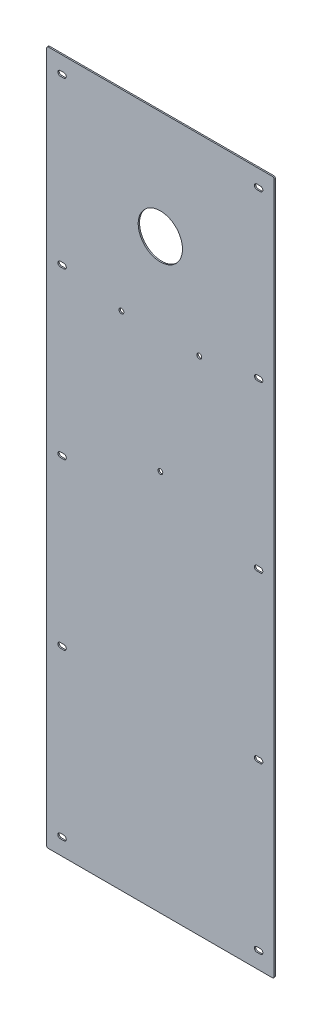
ISO-10303-21;
HEADER;
FILE_DESCRIPTION(('STEP AP214'),'2;1');
FILE_NAME('part.step','',(''),(''),'','','');
FILE_SCHEMA(('AUTOMOTIVE_DESIGN { 1 0 10303 214 1 1 1 1 }'));
ENDSEC;
DATA;
#1=APPLICATION_CONTEXT('core data for automotive mechanical design processes');
#2=APPLICATION_PROTOCOL_DEFINITION('international standard','automotive_design',2000,#1);
#3=PRODUCT_CONTEXT('',#1,'mechanical');
#4=PRODUCT('Part','Part','',(#3));
#5=PRODUCT_RELATED_PRODUCT_CATEGORY('part','',(#4));
#6=PRODUCT_DEFINITION_FORMATION('','',#4);
#7=PRODUCT_DEFINITION_CONTEXT('part definition',#1,'design');
#8=PRODUCT_DEFINITION('design','',#6,#7);
#9=PRODUCT_DEFINITION_SHAPE('','',#8);
#10=(LENGTH_UNIT() NAMED_UNIT(*) SI_UNIT(.MILLI.,.METRE.));
#11=(NAMED_UNIT(*) PLANE_ANGLE_UNIT() SI_UNIT($,.RADIAN.));
#12=(NAMED_UNIT(*) SI_UNIT($,.STERADIAN.) SOLID_ANGLE_UNIT());
#13=UNCERTAINTY_MEASURE_WITH_UNIT(LENGTH_MEASURE(1.E-05),#10,'distance_accuracy_value','');
#14=(GEOMETRIC_REPRESENTATION_CONTEXT(3) GLOBAL_UNCERTAINTY_ASSIGNED_CONTEXT((#13)) GLOBAL_UNIT_ASSIGNED_CONTEXT((#10,
#11,#12)) REPRESENTATION_CONTEXT('',''));
#15=CARTESIAN_POINT('',(0.,0.,0.));
#16=DIRECTION('',(0.,0.,1.));
#17=DIRECTION('',(1.,0.,0.));
#18=AXIS2_PLACEMENT_3D('',#15,#16,#17);
#19=CARTESIAN_POINT('',(0.,0.,1.5));
#20=DIRECTION('',(0.,0.,-1.));
#21=DIRECTION('',(-1.,0.,0.));
#22=AXIS2_PLACEMENT_3D('',#19,#20,#21);
#23=PLANE('',#22);
#24=CARTESIAN_POINT('',(0.,270.,1.5));
#25=DIRECTION('',(0.,0.,1.));
#26=DIRECTION('',(1.,0.,0.));
#27=AXIS2_PLACEMENT_3D('',#24,#25,#26);
#28=CIRCLE('',#27,25.);
#29=CARTESIAN_POINT('',(25.,270.,1.5));
#30=VERTEX_POINT('',#29);
#31=EDGE_CURVE('E370',#30,#30,#28,.T.);
#32=ORIENTED_EDGE('',*,*,#31,.F.);
#33=EDGE_LOOP('',(#32));
#34=FACE_BOUND('',#33,.T.);
#35=DIRECTION('',(1.,0.,0.));
#36=VECTOR('',#35,1.);
#37=CARTESIAN_POINT('',(-113.,370.25,1.5));
#38=LINE('',#37,#36);
#39=CARTESIAN_POINT('',(-113.,370.25,1.5));
#40=VERTEX_POINT('',#39);
#41=CARTESIAN_POINT('',(-109.,370.25,1.5));
#42=VERTEX_POINT('',#41);
#43=EDGE_CURVE('E667',#40,#42,#38,.T.);
#44=ORIENTED_EDGE('',*,*,#43,.F.);
#45=CARTESIAN_POINT('',(-113.,373.,1.5));
#46=DIRECTION('',(0.,0.,1.));
#47=DIRECTION('',(1.,0.,0.));
#48=AXIS2_PLACEMENT_3D('',#45,#46,#47);
#49=CIRCLE('',#48,2.74999999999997);
#50=CARTESIAN_POINT('',(-113.,375.75,1.5));
#51=VERTEX_POINT('',#50);
#52=EDGE_CURVE('E383',#51,#40,#49,.T.);
#53=ORIENTED_EDGE('',*,*,#52,.F.);
#54=DIRECTION('',(-1.,0.,0.));
#55=VECTOR('',#54,1.);
#56=CARTESIAN_POINT('',(-113.,375.75,1.5));
#57=LINE('',#56,#55);
#58=CARTESIAN_POINT('',(-109.,375.75,1.5));
#59=VERTEX_POINT('',#58);
#60=EDGE_CURVE('E656',#59,#51,#57,.T.);
#61=ORIENTED_EDGE('',*,*,#60,.F.);
#62=CARTESIAN_POINT('',(-109.,373.,1.5));
#63=DIRECTION('',(0.,0.,1.));
#64=DIRECTION('',(1.,0.,0.));
#65=AXIS2_PLACEMENT_3D('',#62,#63,#64);
#66=CIRCLE('',#65,2.74999999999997);
#67=EDGE_CURVE('E669',#42,#59,#66,.T.);
#68=ORIENTED_EDGE('',*,*,#67,.F.);
#69=EDGE_LOOP('',(#44,#53,#61,#68));
#70=FACE_BOUND('',#69,.T.);
#71=DIRECTION('',(1.,0.,0.));
#72=VECTOR('',#71,1.);
#73=CARTESIAN_POINT('',(-113.,-375.75,1.5));
#74=LINE('',#73,#72);
#75=CARTESIAN_POINT('',(-113.,-375.75,1.5));
#76=VERTEX_POINT('',#75);
#77=CARTESIAN_POINT('',(-109.,-375.75,1.5));
#78=VERTEX_POINT('',#77);
#79=EDGE_CURVE('E470',#76,#78,#74,.T.);
#80=ORIENTED_EDGE('',*,*,#79,.F.);
#81=CARTESIAN_POINT('',(-113.,-373.,1.5));
#82=DIRECTION('',(0.,0.,1.));
#83=DIRECTION('',(1.,0.,0.));
#84=AXIS2_PLACEMENT_3D('',#81,#82,#83);
#85=CIRCLE('',#84,2.74999999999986);
#86=CARTESIAN_POINT('',(-113.,-370.25,1.5));
#87=VERTEX_POINT('',#86);
#88=EDGE_CURVE('E468',#87,#76,#85,.T.);
#89=ORIENTED_EDGE('',*,*,#88,.F.);
#90=DIRECTION('',(-1.,0.,0.));
#91=VECTOR('',#90,1.);
#92=CARTESIAN_POINT('',(-113.,-370.25,1.5));
#93=LINE('',#92,#91);
#94=CARTESIAN_POINT('',(-109.,-370.25,1.5));
#95=VERTEX_POINT('',#94);
#96=EDGE_CURVE('E458',#95,#87,#93,.T.);
#97=ORIENTED_EDGE('',*,*,#96,.F.);
#98=CARTESIAN_POINT('',(-109.,-373.,1.5));
#99=DIRECTION('',(0.,0.,1.));
#100=DIRECTION('',(1.,0.,0.));
#101=AXIS2_PLACEMENT_3D('',#98,#99,#100);
#102=CIRCLE('',#101,2.74999999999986);
#103=EDGE_CURVE('E473',#78,#95,#102,.T.);
#104=ORIENTED_EDGE('',*,*,#103,.F.);
#105=EDGE_LOOP('',(#80,#89,#97,#104));
#106=FACE_BOUND('',#105,.T.);
#107=DIRECTION('',(-1.,0.,0.));
#108=VECTOR('',#107,1.);
#109=CARTESIAN_POINT('',(113.,375.75,1.5));
#110=LINE('',#109,#108);
#111=CARTESIAN_POINT('',(113.,375.75,1.5));
#112=VERTEX_POINT('',#111);
#113=CARTESIAN_POINT('',(109.,375.75,1.5));
#114=VERTEX_POINT('',#113);
#115=EDGE_CURVE('E503',#112,#114,#110,.T.);
#116=ORIENTED_EDGE('',*,*,#115,.F.);
#117=CARTESIAN_POINT('',(113.,373.,1.5));
#118=DIRECTION('',(0.,0.,1.));
#119=DIRECTION('',(-1.,0.,0.));
#120=AXIS2_PLACEMENT_3D('',#117,#118,#119);
#121=CIRCLE('',#120,2.74999999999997);
#122=CARTESIAN_POINT('',(113.,370.25,1.5));
#123=VERTEX_POINT('',#122);
#124=EDGE_CURVE('E501',#123,#112,#121,.T.);
#125=ORIENTED_EDGE('',*,*,#124,.F.);
#126=DIRECTION('',(1.,0.,0.));
#127=VECTOR('',#126,1.);
#128=CARTESIAN_POINT('',(113.,370.25,1.5));
#129=LINE('',#128,#127);
#130=CARTESIAN_POINT('',(109.,370.25,1.5));
#131=VERTEX_POINT('',#130);
#132=EDGE_CURVE('E491',#131,#123,#129,.T.);
#133=ORIENTED_EDGE('',*,*,#132,.F.);
#134=CARTESIAN_POINT('',(109.,373.,1.5));
#135=DIRECTION('',(0.,0.,1.));
#136=DIRECTION('',(-1.,0.,0.));
#137=AXIS2_PLACEMENT_3D('',#134,#135,#136);
#138=CIRCLE('',#137,2.74999999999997);
#139=EDGE_CURVE('E506',#114,#131,#138,.T.);
#140=ORIENTED_EDGE('',*,*,#139,.F.);
#141=EDGE_LOOP('',(#116,#125,#133,#140));
#142=FACE_BOUND('',#141,.T.);
#143=DIRECTION('',(1.,0.,0.));
#144=VECTOR('',#143,1.);
#145=CARTESIAN_POINT('',(-113.,-189.25,1.5));
#146=LINE('',#145,#144);
#147=CARTESIAN_POINT('',(-113.,-189.25,1.5));
#148=VERTEX_POINT('',#147);
#149=CARTESIAN_POINT('',(-109.,-189.25,1.5));
#150=VERTEX_POINT('',#149);
#151=EDGE_CURVE('E437',#148,#150,#146,.T.);
#152=ORIENTED_EDGE('',*,*,#151,.F.);
#153=CARTESIAN_POINT('',(-113.,-186.5,1.5));
#154=DIRECTION('',(0.,0.,1.));
#155=DIRECTION('',(1.,0.,0.));
#156=AXIS2_PLACEMENT_3D('',#153,#154,#155);
#157=CIRCLE('',#156,2.74999999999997);
#158=CARTESIAN_POINT('',(-113.,-183.75,1.5));
#159=VERTEX_POINT('',#158);
#160=EDGE_CURVE('E435',#159,#148,#157,.T.);
#161=ORIENTED_EDGE('',*,*,#160,.F.);
#162=DIRECTION('',(-1.,0.,0.));
#163=VECTOR('',#162,1.);
#164=CARTESIAN_POINT('',(-113.,-183.75,1.5));
#165=LINE('',#164,#163);
#166=CARTESIAN_POINT('',(-109.,-183.75,1.5));
#167=VERTEX_POINT('',#166);
#168=EDGE_CURVE('E425',#167,#159,#165,.T.);
#169=ORIENTED_EDGE('',*,*,#168,.F.);
#170=CARTESIAN_POINT('',(-109.,-186.5,1.5));
#171=DIRECTION('',(0.,0.,1.));
#172=DIRECTION('',(1.,0.,0.));
#173=AXIS2_PLACEMENT_3D('',#170,#171,#172);
#174=CIRCLE('',#173,2.74999999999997);
#175=EDGE_CURVE('E440',#150,#167,#174,.T.);
#176=ORIENTED_EDGE('',*,*,#175,.F.);
#177=EDGE_LOOP('',(#152,#161,#169,#176));
#178=FACE_BOUND('',#177,.T.);
#179=DIRECTION('',(-1.,0.,0.));
#180=VECTOR('',#179,1.);
#181=CARTESIAN_POINT('',(113.,-183.75,1.5));
#182=LINE('',#181,#180);
#183=CARTESIAN_POINT('',(113.,-183.75,1.5));
#184=VERTEX_POINT('',#183);
#185=CARTESIAN_POINT('',(109.,-183.75,1.5));
#186=VERTEX_POINT('',#185);
#187=EDGE_CURVE('E602',#184,#186,#182,.T.);
#188=ORIENTED_EDGE('',*,*,#187,.F.);
#189=CARTESIAN_POINT('',(113.,-186.5,1.5));
#190=DIRECTION('',(0.,0.,1.));
#191=DIRECTION('',(-1.,0.,0.));
#192=AXIS2_PLACEMENT_3D('',#189,#190,#191);
#193=CIRCLE('',#192,2.74999999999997);
#194=CARTESIAN_POINT('',(113.,-189.25,1.5));
#195=VERTEX_POINT('',#194);
#196=EDGE_CURVE('E600',#195,#184,#193,.T.);
#197=ORIENTED_EDGE('',*,*,#196,.F.);
#198=DIRECTION('',(1.,0.,0.));
#199=VECTOR('',#198,1.);
#200=CARTESIAN_POINT('',(113.,-189.25,1.5));
#201=LINE('',#200,#199);
#202=CARTESIAN_POINT('',(109.,-189.25,1.5));
#203=VERTEX_POINT('',#202);
#204=EDGE_CURVE('E590',#203,#195,#201,.T.);
#205=ORIENTED_EDGE('',*,*,#204,.F.);
#206=CARTESIAN_POINT('',(109.,-186.5,1.5));
#207=DIRECTION('',(0.,0.,1.));
#208=DIRECTION('',(-1.,0.,0.));
#209=AXIS2_PLACEMENT_3D('',#206,#207,#208);
#210=CIRCLE('',#209,2.74999999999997);
#211=EDGE_CURVE('E605',#186,#203,#210,.T.);
#212=ORIENTED_EDGE('',*,*,#211,.F.);
#213=EDGE_LOOP('',(#188,#197,#205,#212));
#214=FACE_BOUND('',#213,.T.);
#215=DIRECTION('',(1.,0.,0.));
#216=VECTOR('',#215,1.);
#217=CARTESIAN_POINT('',(-113.,183.75,1.5));
#218=LINE('',#217,#216);
#219=CARTESIAN_POINT('',(-113.,183.75,1.5));
#220=VERTEX_POINT('',#219);
#221=CARTESIAN_POINT('',(-109.,183.75,1.5));
#222=VERTEX_POINT('',#221);
#223=EDGE_CURVE('E376',#220,#222,#218,.T.);
#224=ORIENTED_EDGE('',*,*,#223,.F.);
#225=CARTESIAN_POINT('',(-113.,186.5,1.5));
#226=DIRECTION('',(0.,0.,1.));
#227=DIRECTION('',(1.,0.,0.));
#228=AXIS2_PLACEMENT_3D('',#225,#226,#227);
#229=CIRCLE('',#228,2.74999999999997);
#230=CARTESIAN_POINT('',(-113.,189.25,1.5));
#231=VERTEX_POINT('',#230);
#232=EDGE_CURVE('E360',#231,#220,#229,.T.);
#233=ORIENTED_EDGE('',*,*,#232,.F.);
#234=DIRECTION('',(-1.,0.,0.));
#235=VECTOR('',#234,1.);
#236=CARTESIAN_POINT('',(-113.,189.25,1.5));
#237=LINE('',#236,#235);
#238=CARTESIAN_POINT('',(-109.,189.25,1.5));
#239=VERTEX_POINT('',#238);
#240=EDGE_CURVE('E365',#239,#231,#237,.T.);
#241=ORIENTED_EDGE('',*,*,#240,.F.);
#242=CARTESIAN_POINT('',(-109.,186.5,1.5));
#243=DIRECTION('',(0.,0.,1.));
#244=DIRECTION('',(1.,0.,0.));
#245=AXIS2_PLACEMENT_3D('',#242,#243,#244);
#246=CIRCLE('',#245,2.74999999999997);
#247=EDGE_CURVE('E367',#222,#239,#246,.T.);
#248=ORIENTED_EDGE('',*,*,#247,.F.);
#249=EDGE_LOOP('',(#224,#233,#241,#248));
#250=FACE_BOUND('',#249,.T.);
#251=DIRECTION('',(-1.,0.,0.));
#252=VECTOR('',#251,1.);
#253=CARTESIAN_POINT('',(113.,189.25,1.5));
#254=LINE('',#253,#252);
#255=CARTESIAN_POINT('',(113.,189.25,1.5));
#256=VERTEX_POINT('',#255);
#257=CARTESIAN_POINT('',(109.,189.25,1.5));
#258=VERTEX_POINT('',#257);
#259=EDGE_CURVE('E536',#256,#258,#254,.T.);
#260=ORIENTED_EDGE('',*,*,#259,.F.);
#261=CARTESIAN_POINT('',(113.,186.5,1.5));
#262=DIRECTION('',(0.,0.,1.));
#263=DIRECTION('',(-1.,0.,0.));
#264=AXIS2_PLACEMENT_3D('',#261,#262,#263);
#265=CIRCLE('',#264,2.74999999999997);
#266=CARTESIAN_POINT('',(113.,183.75,1.5));
#267=VERTEX_POINT('',#266);
#268=EDGE_CURVE('E534',#267,#256,#265,.T.);
#269=ORIENTED_EDGE('',*,*,#268,.F.);
#270=DIRECTION('',(1.,0.,0.));
#271=VECTOR('',#270,1.);
#272=CARTESIAN_POINT('',(113.,183.75,1.5));
#273=LINE('',#272,#271);
#274=CARTESIAN_POINT('',(109.,183.75,1.5));
#275=VERTEX_POINT('',#274);
#276=EDGE_CURVE('E524',#275,#267,#273,.T.);
#277=ORIENTED_EDGE('',*,*,#276,.F.);
#278=CARTESIAN_POINT('',(109.,186.5,1.5));
#279=DIRECTION('',(0.,0.,1.));
#280=DIRECTION('',(-1.,0.,0.));
#281=AXIS2_PLACEMENT_3D('',#278,#279,#280);
#282=CIRCLE('',#281,2.74999999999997);
#283=EDGE_CURVE('E539',#258,#275,#282,.T.);
#284=ORIENTED_EDGE('',*,*,#283,.F.);
#285=EDGE_LOOP('',(#260,#269,#277,#284));
#286=FACE_BOUND('',#285,.T.);
#287=DIRECTION('',(1.,0.,0.));
#288=VECTOR('',#287,1.);
#289=CARTESIAN_POINT('',(-128.5,-392.,1.5));
#290=LINE('',#289,#288);
#291=CARTESIAN_POINT('',(-126.5,-392.,1.5));
#292=VERTEX_POINT('',#291);
#293=CARTESIAN_POINT('',(126.5,-392.,1.5));
#294=VERTEX_POINT('',#293);
#295=EDGE_CURVE('E693',#292,#294,#290,.T.);
#296=ORIENTED_EDGE('',*,*,#295,.T.);
#297=CARTESIAN_POINT('',(126.5,-390.,1.5));
#298=DIRECTION('',(0.,0.,-1.));
#299=DIRECTION('',(-1.,0.,0.));
#300=AXIS2_PLACEMENT_3D('',#297,#298,#299);
#301=CIRCLE('',#300,2.);
#302=CARTESIAN_POINT('',(128.5,-390.,1.5));
#303=VERTEX_POINT('',#302);
#304=EDGE_CURVE('E728',#294,#303,#301,.F.);
#305=ORIENTED_EDGE('',*,*,#304,.T.);
#306=DIRECTION('',(0.,1.,0.));
#307=VECTOR('',#306,1.);
#308=CARTESIAN_POINT('',(128.5,-392.,1.5));
#309=LINE('',#308,#307);
#310=CARTESIAN_POINT('',(128.5,390.,1.5));
#311=VERTEX_POINT('',#310);
#312=EDGE_CURVE('E685',#303,#311,#309,.T.);
#313=ORIENTED_EDGE('',*,*,#312,.T.);
#314=CARTESIAN_POINT('',(126.5,390.,1.5));
#315=DIRECTION('',(0.,0.,-1.));
#316=DIRECTION('',(-1.,0.,0.));
#317=AXIS2_PLACEMENT_3D('',#314,#315,#316);
#318=CIRCLE('',#317,2.);
#319=CARTESIAN_POINT('',(126.5,392.,1.5));
#320=VERTEX_POINT('',#319);
#321=EDGE_CURVE('E723',#311,#320,#318,.F.);
#322=ORIENTED_EDGE('',*,*,#321,.T.);
#323=DIRECTION('',(-1.,0.,0.));
#324=VECTOR('',#323,1.);
#325=CARTESIAN_POINT('',(-128.5,392.,1.5));
#326=LINE('',#325,#324);
#327=CARTESIAN_POINT('',(-126.5,392.,1.5));
#328=VERTEX_POINT('',#327);
#329=EDGE_CURVE('E688',#320,#328,#326,.T.);
#330=ORIENTED_EDGE('',*,*,#329,.T.);
#331=CARTESIAN_POINT('',(-126.5,390.,1.5));
#332=DIRECTION('',(0.,0.,-1.));
#333=DIRECTION('',(-1.,0.,0.));
#334=AXIS2_PLACEMENT_3D('',#331,#332,#333);
#335=CIRCLE('',#334,2.);
#336=CARTESIAN_POINT('',(-128.5,390.,1.5));
#337=VERTEX_POINT('',#336);
#338=EDGE_CURVE('E56',#328,#337,#335,.F.);
#339=ORIENTED_EDGE('',*,*,#338,.T.);
#340=DIRECTION('',(0.,-1.,0.));
#341=VECTOR('',#340,1.);
#342=CARTESIAN_POINT('',(-128.5,-392.,1.5));
#343=LINE('',#342,#341);
#344=CARTESIAN_POINT('',(-128.5,-390.,1.5));
#345=VERTEX_POINT('',#344);
#346=EDGE_CURVE('E691',#337,#345,#343,.T.);
#347=ORIENTED_EDGE('',*,*,#346,.T.);
#348=CARTESIAN_POINT('',(-126.5,-390.,1.5));
#349=DIRECTION('',(0.,0.,-1.));
#350=DIRECTION('',(-1.,0.,0.));
#351=AXIS2_PLACEMENT_3D('',#348,#349,#350);
#352=CIRCLE('',#351,2.);
#353=EDGE_CURVE('E726',#345,#292,#352,.F.);
#354=ORIENTED_EDGE('',*,*,#353,.T.);
#355=EDGE_LOOP('',(#296,#305,#313,#322,#330,#339,#347,#354));
#356=FACE_BOUND('',#355,.T.);
#357=DIRECTION('',(-1.,0.,0.));
#358=VECTOR('',#357,1.);
#359=CARTESIAN_POINT('',(113.,2.75,1.5));
#360=LINE('',#359,#358);
#361=CARTESIAN_POINT('',(113.,2.75,1.5));
#362=VERTEX_POINT('',#361);
#363=CARTESIAN_POINT('',(109.,2.75,1.5));
#364=VERTEX_POINT('',#363);
#365=EDGE_CURVE('E569',#362,#364,#360,.T.);
#366=ORIENTED_EDGE('',*,*,#365,.F.);
#367=CARTESIAN_POINT('',(113.,0.,1.5));
#368=DIRECTION('',(0.,0.,1.));
#369=DIRECTION('',(-1.,0.,0.));
#370=AXIS2_PLACEMENT_3D('',#367,#368,#369);
#371=CIRCLE('',#370,2.75);
#372=CARTESIAN_POINT('',(113.,-2.75,1.5));
#373=VERTEX_POINT('',#372);
#374=EDGE_CURVE('E567',#373,#362,#371,.T.);
#375=ORIENTED_EDGE('',*,*,#374,.F.);
#376=DIRECTION('',(1.,0.,0.));
#377=VECTOR('',#376,1.);
#378=CARTESIAN_POINT('',(113.,-2.75,1.5));
#379=LINE('',#378,#377);
#380=CARTESIAN_POINT('',(109.,-2.75,1.5));
#381=VERTEX_POINT('',#380);
#382=EDGE_CURVE('E557',#381,#373,#379,.T.);
#383=ORIENTED_EDGE('',*,*,#382,.F.);
#384=CARTESIAN_POINT('',(109.,0.,1.5));
#385=DIRECTION('',(0.,0.,1.));
#386=DIRECTION('',(-1.,0.,0.));
#387=AXIS2_PLACEMENT_3D('',#384,#385,#386);
#388=CIRCLE('',#387,2.75);
#389=EDGE_CURVE('E572',#364,#381,#388,.T.);
#390=ORIENTED_EDGE('',*,*,#389,.F.);
#391=EDGE_LOOP('',(#366,#375,#383,#390));
#392=FACE_BOUND('',#391,.T.);
#393=DIRECTION('',(-1.,0.,0.));
#394=VECTOR('',#393,1.);
#395=CARTESIAN_POINT('',(113.,-370.25,1.5));
#396=LINE('',#395,#394);
#397=CARTESIAN_POINT('',(113.,-370.25,1.5));
#398=VERTEX_POINT('',#397);
#399=CARTESIAN_POINT('',(109.,-370.25,1.5));
#400=VERTEX_POINT('',#399);
#401=EDGE_CURVE('E635',#398,#400,#396,.T.);
#402=ORIENTED_EDGE('',*,*,#401,.F.);
#403=CARTESIAN_POINT('',(113.,-373.,1.5));
#404=DIRECTION('',(0.,0.,1.));
#405=DIRECTION('',(-1.,0.,0.));
#406=AXIS2_PLACEMENT_3D('',#403,#404,#405);
#407=CIRCLE('',#406,2.74999999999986);
#408=CARTESIAN_POINT('',(113.,-375.75,1.5));
#409=VERTEX_POINT('',#408);
#410=EDGE_CURVE('E633',#409,#398,#407,.T.);
#411=ORIENTED_EDGE('',*,*,#410,.F.);
#412=DIRECTION('',(1.,0.,0.));
#413=VECTOR('',#412,1.);
#414=CARTESIAN_POINT('',(113.,-375.75,1.5));
#415=LINE('',#414,#413);
#416=CARTESIAN_POINT('',(109.,-375.75,1.5));
#417=VERTEX_POINT('',#416);
#418=EDGE_CURVE('E623',#417,#409,#415,.T.);
#419=ORIENTED_EDGE('',*,*,#418,.F.);
#420=CARTESIAN_POINT('',(109.,-373.,1.5));
#421=DIRECTION('',(0.,0.,1.));
#422=DIRECTION('',(-1.,0.,0.));
#423=AXIS2_PLACEMENT_3D('',#420,#421,#422);
#424=CIRCLE('',#423,2.74999999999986);
#425=EDGE_CURVE('E638',#400,#417,#424,.T.);
#426=ORIENTED_EDGE('',*,*,#425,.F.);
#427=EDGE_LOOP('',(#402,#411,#419,#426));
#428=FACE_BOUND('',#427,.T.);
#429=DIRECTION('',(1.,0.,0.));
#430=VECTOR('',#429,1.);
#431=CARTESIAN_POINT('',(-113.,-2.75,1.5));
#432=LINE('',#431,#430);
#433=CARTESIAN_POINT('',(-113.,-2.75,1.5));
#434=VERTEX_POINT('',#433);
#435=CARTESIAN_POINT('',(-109.,-2.75,1.5));
#436=VERTEX_POINT('',#435);
#437=EDGE_CURVE('E404',#434,#436,#432,.T.);
#438=ORIENTED_EDGE('',*,*,#437,.F.);
#439=CARTESIAN_POINT('',(-113.,0.,1.5));
#440=DIRECTION('',(0.,0.,1.));
#441=DIRECTION('',(1.,0.,0.));
#442=AXIS2_PLACEMENT_3D('',#439,#440,#441);
#443=CIRCLE('',#442,2.75);
#444=CARTESIAN_POINT('',(-113.,2.75,1.5));
#445=VERTEX_POINT('',#444);
#446=EDGE_CURVE('E402',#445,#434,#443,.T.);
#447=ORIENTED_EDGE('',*,*,#446,.F.);
#448=DIRECTION('',(-1.,0.,0.));
#449=VECTOR('',#448,1.);
#450=CARTESIAN_POINT('',(-113.,2.75,1.5));
#451=LINE('',#450,#449);
#452=CARTESIAN_POINT('',(-109.,2.75,1.5));
#453=VERTEX_POINT('',#452);
#454=EDGE_CURVE('E392',#453,#445,#451,.T.);
#455=ORIENTED_EDGE('',*,*,#454,.F.);
#456=CARTESIAN_POINT('',(-109.,0.,1.5));
#457=DIRECTION('',(0.,0.,1.));
#458=DIRECTION('',(1.,0.,0.));
#459=AXIS2_PLACEMENT_3D('',#456,#457,#458);
#460=CIRCLE('',#459,2.75);
#461=EDGE_CURVE('E407',#436,#453,#460,.T.);
#462=ORIENTED_EDGE('',*,*,#461,.F.);
#463=EDGE_LOOP('',(#438,#447,#455,#462));
#464=FACE_BOUND('',#463,.T.);
#465=CARTESIAN_POINT('',(-44.,175.,1.5));
#466=DIRECTION('',(0.,0.,1.));
#467=DIRECTION('',(1.,0.,0.));
#468=AXIS2_PLACEMENT_3D('',#465,#466,#467);
#469=CIRCLE('',#468,2.74999999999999);
#470=CARTESIAN_POINT('',(-41.25,175.,1.5));
#471=VERTEX_POINT('',#470);
#472=EDGE_CURVE('E1077',#471,#471,#469,.T.);
#473=ORIENTED_EDGE('',*,*,#472,.F.);
#474=EDGE_LOOP('',(#473));
#475=FACE_BOUND('',#474,.T.);
#476=CARTESIAN_POINT('',(44.,175.,1.5));
#477=DIRECTION('',(0.,0.,1.));
#478=DIRECTION('',(1.,0.,0.));
#479=AXIS2_PLACEMENT_3D('',#476,#477,#478);
#480=CIRCLE('',#479,2.74999999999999);
#481=CARTESIAN_POINT('',(46.75,175.,1.5));
#482=VERTEX_POINT('',#481);
#483=EDGE_CURVE('E1081',#482,#482,#480,.T.);
#484=ORIENTED_EDGE('',*,*,#483,.F.);
#485=EDGE_LOOP('',(#484));
#486=FACE_BOUND('',#485,.T.);
#487=CARTESIAN_POINT('',(0.,40.,1.5));
#488=DIRECTION('',(0.,0.,1.));
#489=DIRECTION('',(1.,0.,0.));
#490=AXIS2_PLACEMENT_3D('',#487,#488,#489);
#491=CIRCLE('',#490,2.74999999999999);
#492=CARTESIAN_POINT('',(2.74999999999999,40.,1.5));
#493=VERTEX_POINT('',#492);
#494=EDGE_CURVE('E1084',#493,#493,#491,.T.);
#495=ORIENTED_EDGE('',*,*,#494,.F.);
#496=EDGE_LOOP('',(#495));
#497=FACE_BOUND('',#496,.T.);
#498=ADVANCED_FACE('F34',(#34,#70,#106,#142,#178,#214,#250,#286,#356,#392,#428,#464,#475,#486,
#497),#23,.F.);
#499=CARTESIAN_POINT('',(128.5,-392.,1.5));
#500=DIRECTION('',(-1.,0.,0.));
#501=DIRECTION('',(0.,0.,1.));
#502=AXIS2_PLACEMENT_3D('',#499,#500,#501);
#503=PLANE('',#502);
#504=ORIENTED_EDGE('',*,*,#312,.F.);
#505=DIRECTION('',(0.,0.,-1.));
#506=VECTOR('',#505,1.);
#507=CARTESIAN_POINT('',(128.5,-390.,1.5));
#508=LINE('',#507,#506);
#509=CARTESIAN_POINT('',(128.5,-390.,0.));
#510=VERTEX_POINT('',#509);
#511=EDGE_CURVE('E707',#303,#510,#508,.T.);
#512=ORIENTED_EDGE('',*,*,#511,.T.);
#513=DIRECTION('',(0.,1.,0.));
#514=VECTOR('',#513,1.);
#515=CARTESIAN_POINT('',(128.5,-392.,0.));
#516=LINE('',#515,#514);
#517=CARTESIAN_POINT('',(128.5,390.,0.));
#518=VERTEX_POINT('',#517);
#519=EDGE_CURVE('E676',#510,#518,#516,.T.);
#520=ORIENTED_EDGE('',*,*,#519,.T.);
#521=DIRECTION('',(0.,0.,-1.));
#522=VECTOR('',#521,1.);
#523=CARTESIAN_POINT('',(128.5,390.,1.5));
#524=LINE('',#523,#522);
#525=EDGE_CURVE('E696',#518,#311,#524,.F.);
#526=ORIENTED_EDGE('',*,*,#525,.T.);
#527=EDGE_LOOP('',(#504,#512,#520,#526));
#528=FACE_BOUND('',#527,.T.);
#529=ADVANCED_FACE('F765',(#528),#503,.F.);
#530=CARTESIAN_POINT('',(-128.5,392.,1.5));
#531=DIRECTION('',(0.,-1.,0.));
#532=DIRECTION('',(0.,0.,-1.));
#533=AXIS2_PLACEMENT_3D('',#530,#531,#532);
#534=PLANE('',#533);
#535=DIRECTION('',(-1.,0.,0.));
#536=VECTOR('',#535,1.);
#537=CARTESIAN_POINT('',(-128.5,392.,0.));
#538=LINE('',#537,#536);
#539=CARTESIAN_POINT('',(126.5,392.,0.));
#540=VERTEX_POINT('',#539);
#541=CARTESIAN_POINT('',(-126.5,392.,0.));
#542=VERTEX_POINT('',#541);
#543=EDGE_CURVE('E699',#540,#542,#538,.T.);
#544=ORIENTED_EDGE('',*,*,#543,.T.);
#545=DIRECTION('',(0.,0.,-1.));
#546=VECTOR('',#545,1.);
#547=CARTESIAN_POINT('',(-126.5,392.,1.5));
#548=LINE('',#547,#546);
#549=EDGE_CURVE('E11',#542,#328,#548,.F.);
#550=ORIENTED_EDGE('',*,*,#549,.T.);
#551=ORIENTED_EDGE('',*,*,#329,.F.);
#552=DIRECTION('',(0.,0.,-1.));
#553=VECTOR('',#552,1.);
#554=CARTESIAN_POINT('',(126.5,392.,1.5));
#555=LINE('',#554,#553);
#556=EDGE_CURVE('E42',#320,#540,#555,.T.);
#557=ORIENTED_EDGE('',*,*,#556,.T.);
#558=EDGE_LOOP('',(#544,#550,#551,#557));
#559=FACE_BOUND('',#558,.T.);
#560=ADVANCED_FACE('F738',(#559),#534,.F.);
#561=CARTESIAN_POINT('',(-128.5,-392.,1.5));
#562=DIRECTION('',(1.,0.,0.));
#563=DIRECTION('',(0.,0.,-1.));
#564=AXIS2_PLACEMENT_3D('',#561,#562,#563);
#565=PLANE('',#564);
#566=DIRECTION('',(0.,-1.,0.));
#567=VECTOR('',#566,1.);
#568=CARTESIAN_POINT('',(-128.5,-392.,0.));
#569=LINE('',#568,#567);
#570=CARTESIAN_POINT('',(-128.5,390.,0.));
#571=VERTEX_POINT('',#570);
#572=CARTESIAN_POINT('',(-128.5,-390.,0.));
#573=VERTEX_POINT('',#572);
#574=EDGE_CURVE('E702',#571,#573,#569,.T.);
#575=ORIENTED_EDGE('',*,*,#574,.T.);
#576=DIRECTION('',(0.,0.,-1.));
#577=VECTOR('',#576,1.);
#578=CARTESIAN_POINT('',(-128.5,-390.,1.5));
#579=LINE('',#578,#577);
#580=EDGE_CURVE('E49',#573,#345,#579,.F.);
#581=ORIENTED_EDGE('',*,*,#580,.T.);
#582=ORIENTED_EDGE('',*,*,#346,.F.);
#583=DIRECTION('',(0.,0.,-1.));
#584=VECTOR('',#583,1.);
#585=CARTESIAN_POINT('',(-128.5,390.,1.5));
#586=LINE('',#585,#584);
#587=EDGE_CURVE('E730',#337,#571,#586,.T.);
#588=ORIENTED_EDGE('',*,*,#587,.T.);
#589=EDGE_LOOP('',(#575,#581,#582,#588));
#590=FACE_BOUND('',#589,.T.);
#591=ADVANCED_FACE('F748',(#590),#565,.F.);
#592=CARTESIAN_POINT('',(-128.5,-392.,1.5));
#593=DIRECTION('',(0.,1.,0.));
#594=DIRECTION('',(0.,0.,1.));
#595=AXIS2_PLACEMENT_3D('',#592,#593,#594);
#596=PLANE('',#595);
#597=DIRECTION('',(1.,0.,0.));
#598=VECTOR('',#597,1.);
#599=CARTESIAN_POINT('',(-128.5,-392.,0.));
#600=LINE('',#599,#598);
#601=CARTESIAN_POINT('',(-126.5,-392.,0.));
#602=VERTEX_POINT('',#601);
#603=CARTESIAN_POINT('',(126.5,-392.,0.));
#604=VERTEX_POINT('',#603);
#605=EDGE_CURVE('E689',#602,#604,#600,.T.);
#606=ORIENTED_EDGE('',*,*,#605,.T.);
#607=DIRECTION('',(0.,0.,-1.));
#608=VECTOR('',#607,1.);
#609=CARTESIAN_POINT('',(126.5,-392.,1.5));
#610=LINE('',#609,#608);
#611=EDGE_CURVE('E721',#604,#294,#610,.F.);
#612=ORIENTED_EDGE('',*,*,#611,.T.);
#613=ORIENTED_EDGE('',*,*,#295,.F.);
#614=DIRECTION('',(0.,0.,-1.));
#615=VECTOR('',#614,1.);
#616=CARTESIAN_POINT('',(-126.5,-392.,1.5));
#617=LINE('',#616,#615);
#618=EDGE_CURVE('E718',#292,#602,#617,.T.);
#619=ORIENTED_EDGE('',*,*,#618,.T.);
#620=EDGE_LOOP('',(#606,#612,#613,#619));
#621=FACE_BOUND('',#620,.T.);
#622=ADVANCED_FACE('F757',(#621),#596,.F.);
#623=CARTESIAN_POINT('',(0.,0.,0.));
#624=DIRECTION('',(0.,0.,-1.));
#625=DIRECTION('',(-1.,0.,0.));
#626=AXIS2_PLACEMENT_3D('',#623,#624,#625);
#627=PLANE('',#626);
#628=CARTESIAN_POINT('',(0.,40.,0.));
#629=DIRECTION('',(0.,0.,1.));
#630=DIRECTION('',(1.,0.,0.));
#631=AXIS2_PLACEMENT_3D('',#628,#629,#630);
#632=CIRCLE('',#631,2.75);
#633=CARTESIAN_POINT('',(2.75,40.,0.));
#634=VERTEX_POINT('',#633);
#635=EDGE_CURVE('E1085',#634,#634,#632,.T.);
#636=ORIENTED_EDGE('',*,*,#635,.T.);
#637=EDGE_LOOP('',(#636));
#638=FACE_BOUND('',#637,.T.);
#639=CARTESIAN_POINT('',(44.,175.,0.));
#640=DIRECTION('',(0.,0.,1.));
#641=DIRECTION('',(1.,0.,0.));
#642=AXIS2_PLACEMENT_3D('',#639,#640,#641);
#643=CIRCLE('',#642,2.75);
#644=CARTESIAN_POINT('',(46.75,175.,0.));
#645=VERTEX_POINT('',#644);
#646=EDGE_CURVE('E1091',#645,#645,#643,.T.);
#647=ORIENTED_EDGE('',*,*,#646,.T.);
#648=EDGE_LOOP('',(#647));
#649=FACE_BOUND('',#648,.T.);
#650=CARTESIAN_POINT('',(-44.,175.,0.));
#651=DIRECTION('',(0.,0.,1.));
#652=DIRECTION('',(1.,0.,0.));
#653=AXIS2_PLACEMENT_3D('',#650,#651,#652);
#654=CIRCLE('',#653,2.75);
#655=CARTESIAN_POINT('',(-41.25,175.,0.));
#656=VERTEX_POINT('',#655);
#657=EDGE_CURVE('E1095',#656,#656,#654,.T.);
#658=ORIENTED_EDGE('',*,*,#657,.T.);
#659=EDGE_LOOP('',(#658));
#660=FACE_BOUND('',#659,.T.);
#661=CARTESIAN_POINT('',(0.,270.,0.));
#662=DIRECTION('',(0.,0.,1.));
#663=DIRECTION('',(1.,0.,0.));
#664=AXIS2_PLACEMENT_3D('',#661,#662,#663);
#665=CIRCLE('',#664,25.);
#666=CARTESIAN_POINT('',(25.,270.,0.));
#667=VERTEX_POINT('',#666);
#668=EDGE_CURVE('E636',#667,#667,#665,.T.);
#669=ORIENTED_EDGE('',*,*,#668,.T.);
#670=EDGE_LOOP('',(#669));
#671=FACE_BOUND('',#670,.T.);
#672=CARTESIAN_POINT('',(-113.,186.5,0.));
#673=DIRECTION('',(0.,0.,1.));
#674=DIRECTION('',(1.,0.,0.));
#675=AXIS2_PLACEMENT_3D('',#672,#673,#674);
#676=CIRCLE('',#675,2.74999999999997);
#677=CARTESIAN_POINT('',(-113.,189.25,0.));
#678=VERTEX_POINT('',#677);
#679=CARTESIAN_POINT('',(-113.,183.75,0.));
#680=VERTEX_POINT('',#679);
#681=EDGE_CURVE('E352',#678,#680,#676,.T.);
#682=ORIENTED_EDGE('',*,*,#681,.T.);
#683=DIRECTION('',(1.,0.,0.));
#684=VECTOR('',#683,1.);
#685=CARTESIAN_POINT('',(-113.,183.75,0.));
#686=LINE('',#685,#684);
#687=CARTESIAN_POINT('',(-109.,183.75,0.));
#688=VERTEX_POINT('',#687);
#689=EDGE_CURVE('E340',#680,#688,#686,.T.);
#690=ORIENTED_EDGE('',*,*,#689,.T.);
#691=CARTESIAN_POINT('',(-109.,186.5,0.));
#692=DIRECTION('',(0.,0.,1.));
#693=DIRECTION('',(1.,0.,0.));
#694=AXIS2_PLACEMENT_3D('',#691,#692,#693);
#695=CIRCLE('',#694,2.74999999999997);
#696=CARTESIAN_POINT('',(-109.,189.25,0.));
#697=VERTEX_POINT('',#696);
#698=EDGE_CURVE('E351',#688,#697,#695,.T.);
#699=ORIENTED_EDGE('',*,*,#698,.T.);
#700=DIRECTION('',(-1.,0.,0.));
#701=VECTOR('',#700,1.);
#702=CARTESIAN_POINT('',(-113.,189.25,0.));
#703=LINE('',#702,#701);
#704=EDGE_CURVE('E361',#697,#678,#703,.T.);
#705=ORIENTED_EDGE('',*,*,#704,.T.);
#706=EDGE_LOOP('',(#682,#690,#699,#705));
#707=FACE_BOUND('',#706,.T.);
#708=CARTESIAN_POINT('',(-113.,0.,0.));
#709=DIRECTION('',(0.,0.,1.));
#710=DIRECTION('',(1.,0.,0.));
#711=AXIS2_PLACEMENT_3D('',#708,#709,#710);
#712=CIRCLE('',#711,2.75);
#713=CARTESIAN_POINT('',(-113.,2.75,0.));
#714=VERTEX_POINT('',#713);
#715=CARTESIAN_POINT('',(-113.,-2.75,0.));
#716=VERTEX_POINT('',#715);
#717=EDGE_CURVE('E388',#714,#716,#712,.T.);
#718=ORIENTED_EDGE('',*,*,#717,.T.);
#719=DIRECTION('',(1.,0.,0.));
#720=VECTOR('',#719,1.);
#721=CARTESIAN_POINT('',(-113.,-2.75,0.));
#722=LINE('',#721,#720);
#723=CARTESIAN_POINT('',(-109.,-2.75,0.));
#724=VERTEX_POINT('',#723);
#725=EDGE_CURVE('E391',#716,#724,#722,.T.);
#726=ORIENTED_EDGE('',*,*,#725,.T.);
#727=CARTESIAN_POINT('',(-109.,0.,0.));
#728=DIRECTION('',(0.,0.,1.));
#729=DIRECTION('',(1.,0.,0.));
#730=AXIS2_PLACEMENT_3D('',#727,#728,#729);
#731=CIRCLE('',#730,2.75);
#732=CARTESIAN_POINT('',(-109.,2.75,0.));
#733=VERTEX_POINT('',#732);
#734=EDGE_CURVE('E395',#724,#733,#731,.T.);
#735=ORIENTED_EDGE('',*,*,#734,.T.);
#736=DIRECTION('',(-1.,0.,0.));
#737=VECTOR('',#736,1.);
#738=CARTESIAN_POINT('',(-113.,2.75,0.));
#739=LINE('',#738,#737);
#740=EDGE_CURVE('E398',#733,#714,#739,.T.);
#741=ORIENTED_EDGE('',*,*,#740,.T.);
#742=EDGE_LOOP('',(#718,#726,#735,#741));
#743=FACE_BOUND('',#742,.T.);
#744=CARTESIAN_POINT('',(-113.,-186.5,0.));
#745=DIRECTION('',(0.,0.,1.));
#746=DIRECTION('',(1.,0.,0.));
#747=AXIS2_PLACEMENT_3D('',#744,#745,#746);
#748=CIRCLE('',#747,2.74999999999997);
#749=CARTESIAN_POINT('',(-113.,-183.75,0.));
#750=VERTEX_POINT('',#749);
#751=CARTESIAN_POINT('',(-113.,-189.25,0.));
#752=VERTEX_POINT('',#751);
#753=EDGE_CURVE('E421',#750,#752,#748,.T.);
#754=ORIENTED_EDGE('',*,*,#753,.T.);
#755=DIRECTION('',(1.,0.,0.));
#756=VECTOR('',#755,1.);
#757=CARTESIAN_POINT('',(-113.,-189.25,0.));
#758=LINE('',#757,#756);
#759=CARTESIAN_POINT('',(-109.,-189.25,0.));
#760=VERTEX_POINT('',#759);
#761=EDGE_CURVE('E424',#752,#760,#758,.T.);
#762=ORIENTED_EDGE('',*,*,#761,.T.);
#763=CARTESIAN_POINT('',(-109.,-186.5,0.));
#764=DIRECTION('',(0.,0.,1.));
#765=DIRECTION('',(1.,0.,0.));
#766=AXIS2_PLACEMENT_3D('',#763,#764,#765);
#767=CIRCLE('',#766,2.74999999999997);
#768=CARTESIAN_POINT('',(-109.,-183.75,0.));
#769=VERTEX_POINT('',#768);
#770=EDGE_CURVE('E428',#760,#769,#767,.T.);
#771=ORIENTED_EDGE('',*,*,#770,.T.);
#772=DIRECTION('',(-1.,0.,0.));
#773=VECTOR('',#772,1.);
#774=CARTESIAN_POINT('',(-113.,-183.75,0.));
#775=LINE('',#774,#773);
#776=EDGE_CURVE('E431',#769,#750,#775,.T.);
#777=ORIENTED_EDGE('',*,*,#776,.T.);
#778=EDGE_LOOP('',(#754,#762,#771,#777));
#779=FACE_BOUND('',#778,.T.);
#780=CARTESIAN_POINT('',(-113.,-373.,0.));
#781=DIRECTION('',(0.,0.,1.));
#782=DIRECTION('',(1.,0.,0.));
#783=AXIS2_PLACEMENT_3D('',#780,#781,#782);
#784=CIRCLE('',#783,2.74999999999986);
#785=CARTESIAN_POINT('',(-113.,-370.25,0.));
#786=VERTEX_POINT('',#785);
#787=CARTESIAN_POINT('',(-113.,-375.75,0.));
#788=VERTEX_POINT('',#787);
#789=EDGE_CURVE('E454',#786,#788,#784,.T.);
#790=ORIENTED_EDGE('',*,*,#789,.T.);
#791=DIRECTION('',(1.,0.,0.));
#792=VECTOR('',#791,1.);
#793=CARTESIAN_POINT('',(-113.,-375.75,0.));
#794=LINE('',#793,#792);
#795=CARTESIAN_POINT('',(-109.,-375.75,0.));
#796=VERTEX_POINT('',#795);
#797=EDGE_CURVE('E457',#788,#796,#794,.T.);
#798=ORIENTED_EDGE('',*,*,#797,.T.);
#799=CARTESIAN_POINT('',(-109.,-373.,0.));
#800=DIRECTION('',(0.,0.,1.));
#801=DIRECTION('',(1.,0.,0.));
#802=AXIS2_PLACEMENT_3D('',#799,#800,#801);
#803=CIRCLE('',#802,2.74999999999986);
#804=CARTESIAN_POINT('',(-109.,-370.25,0.));
#805=VERTEX_POINT('',#804);
#806=EDGE_CURVE('E461',#796,#805,#803,.T.);
#807=ORIENTED_EDGE('',*,*,#806,.T.);
#808=DIRECTION('',(-1.,0.,0.));
#809=VECTOR('',#808,1.);
#810=CARTESIAN_POINT('',(-113.,-370.25,0.));
#811=LINE('',#810,#809);
#812=EDGE_CURVE('E464',#805,#786,#811,.T.);
#813=ORIENTED_EDGE('',*,*,#812,.T.);
#814=EDGE_LOOP('',(#790,#798,#807,#813));
#815=FACE_BOUND('',#814,.T.);
#816=CARTESIAN_POINT('',(113.,373.,0.));
#817=DIRECTION('',(0.,0.,1.));
#818=DIRECTION('',(-1.,0.,0.));
#819=AXIS2_PLACEMENT_3D('',#816,#817,#818);
#820=CIRCLE('',#819,2.74999999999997);
#821=CARTESIAN_POINT('',(113.,370.25,0.));
#822=VERTEX_POINT('',#821);
#823=CARTESIAN_POINT('',(113.,375.75,0.));
#824=VERTEX_POINT('',#823);
#825=EDGE_CURVE('E487',#822,#824,#820,.T.);
#826=ORIENTED_EDGE('',*,*,#825,.T.);
#827=DIRECTION('',(-1.,0.,0.));
#828=VECTOR('',#827,1.);
#829=CARTESIAN_POINT('',(113.,375.75,0.));
#830=LINE('',#829,#828);
#831=CARTESIAN_POINT('',(109.,375.75,0.));
#832=VERTEX_POINT('',#831);
#833=EDGE_CURVE('E490',#824,#832,#830,.T.);
#834=ORIENTED_EDGE('',*,*,#833,.T.);
#835=CARTESIAN_POINT('',(109.,373.,0.));
#836=DIRECTION('',(0.,0.,1.));
#837=DIRECTION('',(-1.,0.,0.));
#838=AXIS2_PLACEMENT_3D('',#835,#836,#837);
#839=CIRCLE('',#838,2.74999999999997);
#840=CARTESIAN_POINT('',(109.,370.25,0.));
#841=VERTEX_POINT('',#840);
#842=EDGE_CURVE('E494',#832,#841,#839,.T.);
#843=ORIENTED_EDGE('',*,*,#842,.T.);
#844=DIRECTION('',(1.,0.,0.));
#845=VECTOR('',#844,1.);
#846=CARTESIAN_POINT('',(113.,370.25,0.));
#847=LINE('',#846,#845);
#848=EDGE_CURVE('E497',#841,#822,#847,.T.);
#849=ORIENTED_EDGE('',*,*,#848,.T.);
#850=EDGE_LOOP('',(#826,#834,#843,#849));
#851=FACE_BOUND('',#850,.T.);
#852=CARTESIAN_POINT('',(113.,186.5,0.));
#853=DIRECTION('',(0.,0.,1.));
#854=DIRECTION('',(-1.,0.,0.));
#855=AXIS2_PLACEMENT_3D('',#852,#853,#854);
#856=CIRCLE('',#855,2.74999999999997);
#857=CARTESIAN_POINT('',(113.,183.75,0.));
#858=VERTEX_POINT('',#857);
#859=CARTESIAN_POINT('',(113.,189.25,0.));
#860=VERTEX_POINT('',#859);
#861=EDGE_CURVE('E520',#858,#860,#856,.T.);
#862=ORIENTED_EDGE('',*,*,#861,.T.);
#863=DIRECTION('',(-1.,0.,0.));
#864=VECTOR('',#863,1.);
#865=CARTESIAN_POINT('',(113.,189.25,0.));
#866=LINE('',#865,#864);
#867=CARTESIAN_POINT('',(109.,189.25,0.));
#868=VERTEX_POINT('',#867);
#869=EDGE_CURVE('E523',#860,#868,#866,.T.);
#870=ORIENTED_EDGE('',*,*,#869,.T.);
#871=CARTESIAN_POINT('',(109.,186.5,0.));
#872=DIRECTION('',(0.,0.,1.));
#873=DIRECTION('',(-1.,0.,0.));
#874=AXIS2_PLACEMENT_3D('',#871,#872,#873);
#875=CIRCLE('',#874,2.74999999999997);
#876=CARTESIAN_POINT('',(109.,183.75,0.));
#877=VERTEX_POINT('',#876);
#878=EDGE_CURVE('E527',#868,#877,#875,.T.);
#879=ORIENTED_EDGE('',*,*,#878,.T.);
#880=DIRECTION('',(1.,0.,0.));
#881=VECTOR('',#880,1.);
#882=CARTESIAN_POINT('',(113.,183.75,0.));
#883=LINE('',#882,#881);
#884=EDGE_CURVE('E530',#877,#858,#883,.T.);
#885=ORIENTED_EDGE('',*,*,#884,.T.);
#886=EDGE_LOOP('',(#862,#870,#879,#885));
#887=FACE_BOUND('',#886,.T.);
#888=CARTESIAN_POINT('',(113.,0.,0.));
#889=DIRECTION('',(0.,0.,1.));
#890=DIRECTION('',(-1.,0.,0.));
#891=AXIS2_PLACEMENT_3D('',#888,#889,#890);
#892=CIRCLE('',#891,2.75);
#893=CARTESIAN_POINT('',(113.,-2.75,0.));
#894=VERTEX_POINT('',#893);
#895=CARTESIAN_POINT('',(113.,2.75,0.));
#896=VERTEX_POINT('',#895);
#897=EDGE_CURVE('E553',#894,#896,#892,.T.);
#898=ORIENTED_EDGE('',*,*,#897,.T.);
#899=DIRECTION('',(-1.,0.,0.));
#900=VECTOR('',#899,1.);
#901=CARTESIAN_POINT('',(113.,2.75,0.));
#902=LINE('',#901,#900);
#903=CARTESIAN_POINT('',(109.,2.75,0.));
#904=VERTEX_POINT('',#903);
#905=EDGE_CURVE('E556',#896,#904,#902,.T.);
#906=ORIENTED_EDGE('',*,*,#905,.T.);
#907=CARTESIAN_POINT('',(109.,0.,0.));
#908=DIRECTION('',(0.,0.,1.));
#909=DIRECTION('',(-1.,0.,0.));
#910=AXIS2_PLACEMENT_3D('',#907,#908,#909);
#911=CIRCLE('',#910,2.75);
#912=CARTESIAN_POINT('',(109.,-2.75,0.));
#913=VERTEX_POINT('',#912);
#914=EDGE_CURVE('E560',#904,#913,#911,.T.);
#915=ORIENTED_EDGE('',*,*,#914,.T.);
#916=DIRECTION('',(1.,0.,0.));
#917=VECTOR('',#916,1.);
#918=CARTESIAN_POINT('',(113.,-2.75,0.));
#919=LINE('',#918,#917);
#920=EDGE_CURVE('E563',#913,#894,#919,.T.);
#921=ORIENTED_EDGE('',*,*,#920,.T.);
#922=EDGE_LOOP('',(#898,#906,#915,#921));
#923=FACE_BOUND('',#922,.T.);
#924=CARTESIAN_POINT('',(113.,-186.5,0.));
#925=DIRECTION('',(0.,0.,1.));
#926=DIRECTION('',(-1.,0.,0.));
#927=AXIS2_PLACEMENT_3D('',#924,#925,#926);
#928=CIRCLE('',#927,2.74999999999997);
#929=CARTESIAN_POINT('',(113.,-189.25,0.));
#930=VERTEX_POINT('',#929);
#931=CARTESIAN_POINT('',(113.,-183.75,0.));
#932=VERTEX_POINT('',#931);
#933=EDGE_CURVE('E586',#930,#932,#928,.T.);
#934=ORIENTED_EDGE('',*,*,#933,.T.);
#935=DIRECTION('',(-1.,0.,0.));
#936=VECTOR('',#935,1.);
#937=CARTESIAN_POINT('',(113.,-183.75,0.));
#938=LINE('',#937,#936);
#939=CARTESIAN_POINT('',(109.,-183.75,0.));
#940=VERTEX_POINT('',#939);
#941=EDGE_CURVE('E589',#932,#940,#938,.T.);
#942=ORIENTED_EDGE('',*,*,#941,.T.);
#943=CARTESIAN_POINT('',(109.,-186.5,0.));
#944=DIRECTION('',(0.,0.,1.));
#945=DIRECTION('',(-1.,0.,0.));
#946=AXIS2_PLACEMENT_3D('',#943,#944,#945);
#947=CIRCLE('',#946,2.74999999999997);
#948=CARTESIAN_POINT('',(109.,-189.25,0.));
#949=VERTEX_POINT('',#948);
#950=EDGE_CURVE('E593',#940,#949,#947,.T.);
#951=ORIENTED_EDGE('',*,*,#950,.T.);
#952=DIRECTION('',(1.,0.,0.));
#953=VECTOR('',#952,1.);
#954=CARTESIAN_POINT('',(113.,-189.25,0.));
#955=LINE('',#954,#953);
#956=EDGE_CURVE('E596',#949,#930,#955,.T.);
#957=ORIENTED_EDGE('',*,*,#956,.T.);
#958=EDGE_LOOP('',(#934,#942,#951,#957));
#959=FACE_BOUND('',#958,.T.);
#960=CARTESIAN_POINT('',(113.,-373.,0.));
#961=DIRECTION('',(0.,0.,1.));
#962=DIRECTION('',(-1.,0.,0.));
#963=AXIS2_PLACEMENT_3D('',#960,#961,#962);
#964=CIRCLE('',#963,2.74999999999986);
#965=CARTESIAN_POINT('',(113.,-375.75,0.));
#966=VERTEX_POINT('',#965);
#967=CARTESIAN_POINT('',(113.,-370.25,0.));
#968=VERTEX_POINT('',#967);
#969=EDGE_CURVE('E619',#966,#968,#964,.T.);
#970=ORIENTED_EDGE('',*,*,#969,.T.);
#971=DIRECTION('',(-1.,0.,0.));
#972=VECTOR('',#971,1.);
#973=CARTESIAN_POINT('',(113.,-370.25,0.));
#974=LINE('',#973,#972);
#975=CARTESIAN_POINT('',(109.,-370.25,0.));
#976=VERTEX_POINT('',#975);
#977=EDGE_CURVE('E622',#968,#976,#974,.T.);
#978=ORIENTED_EDGE('',*,*,#977,.T.);
#979=CARTESIAN_POINT('',(109.,-373.,0.));
#980=DIRECTION('',(0.,0.,1.));
#981=DIRECTION('',(-1.,0.,0.));
#982=AXIS2_PLACEMENT_3D('',#979,#980,#981);
#983=CIRCLE('',#982,2.74999999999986);
#984=CARTESIAN_POINT('',(109.,-375.75,0.));
#985=VERTEX_POINT('',#984);
#986=EDGE_CURVE('E626',#976,#985,#983,.T.);
#987=ORIENTED_EDGE('',*,*,#986,.T.);
#988=DIRECTION('',(1.,0.,0.));
#989=VECTOR('',#988,1.);
#990=CARTESIAN_POINT('',(113.,-375.75,0.));
#991=LINE('',#990,#989);
#992=EDGE_CURVE('E629',#985,#966,#991,.T.);
#993=ORIENTED_EDGE('',*,*,#992,.T.);
#994=EDGE_LOOP('',(#970,#978,#987,#993));
#995=FACE_BOUND('',#994,.T.);
#996=CARTESIAN_POINT('',(-113.,373.,0.));
#997=DIRECTION('',(0.,0.,1.));
#998=DIRECTION('',(1.,0.,0.));
#999=AXIS2_PLACEMENT_3D('',#996,#997,#998);
#1000=CIRCLE('',#999,2.74999999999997);
#1001=CARTESIAN_POINT('',(-113.,375.75,0.));
#1002=VERTEX_POINT('',#1001);
#1003=CARTESIAN_POINT('',(-113.,370.25,0.));
#1004=VERTEX_POINT('',#1003);
#1005=EDGE_CURVE('E652',#1002,#1004,#1000,.T.);
#1006=ORIENTED_EDGE('',*,*,#1005,.T.);
#1007=DIRECTION('',(1.,0.,0.));
#1008=VECTOR('',#1007,1.);
#1009=CARTESIAN_POINT('',(-113.,370.25,0.));
#1010=LINE('',#1009,#1008);
#1011=CARTESIAN_POINT('',(-109.,370.25,0.));
#1012=VERTEX_POINT('',#1011);
#1013=EDGE_CURVE('E655',#1004,#1012,#1010,.T.);
#1014=ORIENTED_EDGE('',*,*,#1013,.T.);
#1015=CARTESIAN_POINT('',(-109.,373.,0.));
#1016=DIRECTION('',(0.,0.,1.));
#1017=DIRECTION('',(1.,0.,0.));
#1018=AXIS2_PLACEMENT_3D('',#1015,#1016,#1017);
#1019=CIRCLE('',#1018,2.74999999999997);
#1020=CARTESIAN_POINT('',(-109.,375.75,0.));
#1021=VERTEX_POINT('',#1020);
#1022=EDGE_CURVE('E659',#1012,#1021,#1019,.T.);
#1023=ORIENTED_EDGE('',*,*,#1022,.T.);
#1024=DIRECTION('',(-1.,0.,0.));
#1025=VECTOR('',#1024,1.);
#1026=CARTESIAN_POINT('',(-113.,375.75,0.));
#1027=LINE('',#1026,#1025);
#1028=EDGE_CURVE('E662',#1021,#1002,#1027,.T.);
#1029=ORIENTED_EDGE('',*,*,#1028,.T.);
#1030=EDGE_LOOP('',(#1006,#1014,#1023,#1029));
#1031=FACE_BOUND('',#1030,.T.);
#1032=ORIENTED_EDGE('',*,*,#519,.F.);
#1033=CARTESIAN_POINT('',(126.5,-390.,0.));
#1034=DIRECTION('',(0.,0.,-1.));
#1035=DIRECTION('',(-1.,0.,0.));
#1036=AXIS2_PLACEMENT_3D('',#1033,#1034,#1035);
#1037=CIRCLE('',#1036,2.);
#1038=EDGE_CURVE('E716',#510,#604,#1037,.T.);
#1039=ORIENTED_EDGE('',*,*,#1038,.T.);
#1040=ORIENTED_EDGE('',*,*,#605,.F.);
#1041=CARTESIAN_POINT('',(-126.5,-390.,0.));
#1042=DIRECTION('',(0.,0.,-1.));
#1043=DIRECTION('',(-1.,0.,0.));
#1044=AXIS2_PLACEMENT_3D('',#1041,#1042,#1043);
#1045=CIRCLE('',#1044,2.);
#1046=EDGE_CURVE('E714',#602,#573,#1045,.T.);
#1047=ORIENTED_EDGE('',*,*,#1046,.T.);
#1048=ORIENTED_EDGE('',*,*,#574,.F.);
#1049=CARTESIAN_POINT('',(-126.5,390.,0.));
#1050=DIRECTION('',(0.,0.,-1.));
#1051=DIRECTION('',(-1.,0.,0.));
#1052=AXIS2_PLACEMENT_3D('',#1049,#1050,#1051);
#1053=CIRCLE('',#1052,2.);
#1054=EDGE_CURVE('E712',#571,#542,#1053,.T.);
#1055=ORIENTED_EDGE('',*,*,#1054,.T.);
#1056=ORIENTED_EDGE('',*,*,#543,.F.);
#1057=CARTESIAN_POINT('',(126.5,390.,0.));
#1058=DIRECTION('',(0.,0.,-1.));
#1059=DIRECTION('',(-1.,0.,0.));
#1060=AXIS2_PLACEMENT_3D('',#1057,#1058,#1059);
#1061=CIRCLE('',#1060,2.);
#1062=EDGE_CURVE('E710',#540,#518,#1061,.T.);
#1063=ORIENTED_EDGE('',*,*,#1062,.T.);
#1064=EDGE_LOOP('',(#1032,#1039,#1040,#1047,#1048,#1055,#1056,#1063));
#1065=FACE_BOUND('',#1064,.T.);
#1066=ADVANCED_FACE('F363',(#638,#649,#660,#671,#707,#743,#779,#815,#851,#887,#923,#959,#995,
#1031,#1065),#627,.T.);
#1067=CARTESIAN_POINT('',(-113.,375.75,0.));
#1068=DIRECTION('',(0.,1.,0.));
#1069=DIRECTION('',(0.,0.,1.));
#1070=AXIS2_PLACEMENT_3D('',#1067,#1068,#1069);
#1071=PLANE('',#1070);
#1072=ORIENTED_EDGE('',*,*,#60,.T.);
#1073=DIRECTION('',(0.,0.,1.));
#1074=VECTOR('',#1073,1.);
#1075=CARTESIAN_POINT('',(-113.,375.75,0.));
#1076=LINE('',#1075,#1074);
#1077=EDGE_CURVE('E673',#1002,#51,#1076,.T.);
#1078=ORIENTED_EDGE('',*,*,#1077,.F.);
#1079=ORIENTED_EDGE('',*,*,#1028,.F.);
#1080=DIRECTION('',(0.,0.,1.));
#1081=VECTOR('',#1080,1.);
#1082=CARTESIAN_POINT('',(-109.,375.75,0.));
#1083=LINE('',#1082,#1081);
#1084=EDGE_CURVE('E677',#1021,#59,#1083,.T.);
#1085=ORIENTED_EDGE('',*,*,#1084,.T.);
#1086=EDGE_LOOP('',(#1072,#1078,#1079,#1085));
#1087=FACE_BOUND('',#1086,.T.);
#1088=ADVANCED_FACE('F791',(#1087),#1071,.F.);
#1089=CARTESIAN_POINT('',(-113.,370.25,0.));
#1090=DIRECTION('',(0.,-1.,0.));
#1091=DIRECTION('',(0.,0.,-1.));
#1092=AXIS2_PLACEMENT_3D('',#1089,#1090,#1091);
#1093=PLANE('',#1092);
#1094=ORIENTED_EDGE('',*,*,#43,.T.);
#1095=DIRECTION('',(0.,0.,1.));
#1096=VECTOR('',#1095,1.);
#1097=CARTESIAN_POINT('',(-109.,370.25,0.));
#1098=LINE('',#1097,#1096);
#1099=EDGE_CURVE('E680',#1012,#42,#1098,.T.);
#1100=ORIENTED_EDGE('',*,*,#1099,.F.);
#1101=ORIENTED_EDGE('',*,*,#1013,.F.);
#1102=DIRECTION('',(0.,0.,1.));
#1103=VECTOR('',#1102,1.);
#1104=CARTESIAN_POINT('',(-113.,370.25,0.));
#1105=LINE('',#1104,#1103);
#1106=EDGE_CURVE('E665',#1004,#40,#1105,.T.);
#1107=ORIENTED_EDGE('',*,*,#1106,.T.);
#1108=EDGE_LOOP('',(#1094,#1100,#1101,#1107));
#1109=FACE_BOUND('',#1108,.T.);
#1110=ADVANCED_FACE('F1011',(#1109),#1093,.F.);
#1111=CARTESIAN_POINT('',(-113.,373.,0.));
#1112=DIRECTION('',(0.,0.,1.));
#1113=DIRECTION('',(1.,0.,0.));
#1114=AXIS2_PLACEMENT_3D('',#1111,#1112,#1113);
#1115=CYLINDRICAL_SURFACE('',#1114,2.74999999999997);
#1116=ORIENTED_EDGE('',*,*,#52,.T.);
#1117=ORIENTED_EDGE('',*,*,#1106,.F.);
#1118=ORIENTED_EDGE('',*,*,#1005,.F.);
#1119=ORIENTED_EDGE('',*,*,#1077,.T.);
#1120=EDGE_LOOP('',(#1116,#1117,#1118,#1119));
#1121=FACE_BOUND('',#1120,.T.);
#1122=ADVANCED_FACE('F787',(#1121),#1115,.F.);
#1123=CARTESIAN_POINT('',(-109.,373.,0.));
#1124=DIRECTION('',(0.,0.,1.));
#1125=DIRECTION('',(1.,0.,0.));
#1126=AXIS2_PLACEMENT_3D('',#1123,#1124,#1125);
#1127=CYLINDRICAL_SURFACE('',#1126,2.74999999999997);
#1128=ORIENTED_EDGE('',*,*,#67,.T.);
#1129=ORIENTED_EDGE('',*,*,#1084,.F.);
#1130=ORIENTED_EDGE('',*,*,#1022,.F.);
#1131=ORIENTED_EDGE('',*,*,#1099,.T.);
#1132=EDGE_LOOP('',(#1128,#1129,#1130,#1131));
#1133=FACE_BOUND('',#1132,.T.);
#1134=ADVANCED_FACE('F998',(#1133),#1127,.F.);
#1135=CARTESIAN_POINT('',(113.,-375.75,0.));
#1136=DIRECTION('',(0.,-1.,0.));
#1137=DIRECTION('',(0.,0.,-1.));
#1138=AXIS2_PLACEMENT_3D('',#1135,#1136,#1137);
#1139=PLANE('',#1138);
#1140=ORIENTED_EDGE('',*,*,#418,.T.);
#1141=DIRECTION('',(0.,0.,1.));
#1142=VECTOR('',#1141,1.);
#1143=CARTESIAN_POINT('',(113.,-375.75,0.));
#1144=LINE('',#1143,#1142);
#1145=EDGE_CURVE('E603',#966,#409,#1144,.T.);
#1146=ORIENTED_EDGE('',*,*,#1145,.F.);
#1147=ORIENTED_EDGE('',*,*,#992,.F.);
#1148=DIRECTION('',(0.,0.,1.));
#1149=VECTOR('',#1148,1.);
#1150=CARTESIAN_POINT('',(109.,-375.75,0.));
#1151=LINE('',#1150,#1149);
#1152=EDGE_CURVE('E644',#985,#417,#1151,.T.);
#1153=ORIENTED_EDGE('',*,*,#1152,.T.);
#1154=EDGE_LOOP('',(#1140,#1146,#1147,#1153));
#1155=FACE_BOUND('',#1154,.T.);
#1156=ADVANCED_FACE('F994',(#1155),#1139,.F.);
#1157=CARTESIAN_POINT('',(113.,-370.25,0.));
#1158=DIRECTION('',(0.,1.,0.));
#1159=DIRECTION('',(0.,0.,1.));
#1160=AXIS2_PLACEMENT_3D('',#1157,#1158,#1159);
#1161=PLANE('',#1160);
#1162=ORIENTED_EDGE('',*,*,#401,.T.);
#1163=DIRECTION('',(0.,0.,1.));
#1164=VECTOR('',#1163,1.);
#1165=CARTESIAN_POINT('',(109.,-370.25,0.));
#1166=LINE('',#1165,#1164);
#1167=EDGE_CURVE('E647',#976,#400,#1166,.T.);
#1168=ORIENTED_EDGE('',*,*,#1167,.F.);
#1169=ORIENTED_EDGE('',*,*,#977,.F.);
#1170=DIRECTION('',(0.,0.,1.));
#1171=VECTOR('',#1170,1.);
#1172=CARTESIAN_POINT('',(113.,-370.25,0.));
#1173=LINE('',#1172,#1171);
#1174=EDGE_CURVE('E632',#968,#398,#1173,.T.);
#1175=ORIENTED_EDGE('',*,*,#1174,.T.);
#1176=EDGE_LOOP('',(#1162,#1168,#1169,#1175));
#1177=FACE_BOUND('',#1176,.T.);
#1178=ADVANCED_FACE('F997',(#1177),#1161,.F.);
#1179=CARTESIAN_POINT('',(113.,-373.,0.));
#1180=DIRECTION('',(0.,0.,1.));
#1181=DIRECTION('',(1.,0.,0.));
#1182=AXIS2_PLACEMENT_3D('',#1179,#1180,#1181);
#1183=CYLINDRICAL_SURFACE('',#1182,2.74999999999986);
#1184=ORIENTED_EDGE('',*,*,#410,.T.);
#1185=ORIENTED_EDGE('',*,*,#1174,.F.);
#1186=ORIENTED_EDGE('',*,*,#969,.F.);
#1187=ORIENTED_EDGE('',*,*,#1145,.T.);
#1188=EDGE_LOOP('',(#1184,#1185,#1186,#1187));
#1189=FACE_BOUND('',#1188,.T.);
#1190=ADVANCED_FACE('F1002',(#1189),#1183,.F.);
#1191=CARTESIAN_POINT('',(109.,-373.,0.));
#1192=DIRECTION('',(0.,0.,1.));
#1193=DIRECTION('',(1.,0.,0.));
#1194=AXIS2_PLACEMENT_3D('',#1191,#1192,#1193);
#1195=CYLINDRICAL_SURFACE('',#1194,2.74999999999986);
#1196=ORIENTED_EDGE('',*,*,#425,.T.);
#1197=ORIENTED_EDGE('',*,*,#1152,.F.);
#1198=ORIENTED_EDGE('',*,*,#986,.F.);
#1199=ORIENTED_EDGE('',*,*,#1167,.T.);
#1200=EDGE_LOOP('',(#1196,#1197,#1198,#1199));
#1201=FACE_BOUND('',#1200,.T.);
#1202=ADVANCED_FACE('F982',(#1201),#1195,.F.);
#1203=CARTESIAN_POINT('',(113.,-189.25,0.));
#1204=DIRECTION('',(0.,-1.,0.));
#1205=DIRECTION('',(0.,0.,-1.));
#1206=AXIS2_PLACEMENT_3D('',#1203,#1204,#1205);
#1207=PLANE('',#1206);
#1208=ORIENTED_EDGE('',*,*,#204,.T.);
#1209=DIRECTION('',(0.,0.,1.));
#1210=VECTOR('',#1209,1.);
#1211=CARTESIAN_POINT('',(113.,-189.25,0.));
#1212=LINE('',#1211,#1210);
#1213=EDGE_CURVE('E570',#930,#195,#1212,.T.);
#1214=ORIENTED_EDGE('',*,*,#1213,.F.);
#1215=ORIENTED_EDGE('',*,*,#956,.F.);
#1216=DIRECTION('',(0.,0.,1.));
#1217=VECTOR('',#1216,1.);
#1218=CARTESIAN_POINT('',(109.,-189.25,0.));
#1219=LINE('',#1218,#1217);
#1220=EDGE_CURVE('E611',#949,#203,#1219,.T.);
#1221=ORIENTED_EDGE('',*,*,#1220,.T.);
#1222=EDGE_LOOP('',(#1208,#1214,#1215,#1221));
#1223=FACE_BOUND('',#1222,.T.);
#1224=ADVANCED_FACE('F978',(#1223),#1207,.F.);
#1225=CARTESIAN_POINT('',(113.,-183.75,0.));
#1226=DIRECTION('',(0.,1.,0.));
#1227=DIRECTION('',(0.,0.,1.));
#1228=AXIS2_PLACEMENT_3D('',#1225,#1226,#1227);
#1229=PLANE('',#1228);
#1230=ORIENTED_EDGE('',*,*,#187,.T.);
#1231=DIRECTION('',(0.,0.,1.));
#1232=VECTOR('',#1231,1.);
#1233=CARTESIAN_POINT('',(109.,-183.75,0.));
#1234=LINE('',#1233,#1232);
#1235=EDGE_CURVE('E614',#940,#186,#1234,.T.);
#1236=ORIENTED_EDGE('',*,*,#1235,.F.);
#1237=ORIENTED_EDGE('',*,*,#941,.F.);
#1238=DIRECTION('',(0.,0.,1.));
#1239=VECTOR('',#1238,1.);
#1240=CARTESIAN_POINT('',(113.,-183.75,0.));
#1241=LINE('',#1240,#1239);
#1242=EDGE_CURVE('E599',#932,#184,#1241,.T.);
#1243=ORIENTED_EDGE('',*,*,#1242,.T.);
#1244=EDGE_LOOP('',(#1230,#1236,#1237,#1243));
#1245=FACE_BOUND('',#1244,.T.);
#1246=ADVANCED_FACE('F981',(#1245),#1229,.F.);
#1247=CARTESIAN_POINT('',(113.,-186.5,0.));
#1248=DIRECTION('',(0.,0.,1.));
#1249=DIRECTION('',(1.,0.,0.));
#1250=AXIS2_PLACEMENT_3D('',#1247,#1248,#1249);
#1251=CYLINDRICAL_SURFACE('',#1250,2.74999999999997);
#1252=ORIENTED_EDGE('',*,*,#196,.T.);
#1253=ORIENTED_EDGE('',*,*,#1242,.F.);
#1254=ORIENTED_EDGE('',*,*,#933,.F.);
#1255=ORIENTED_EDGE('',*,*,#1213,.T.);
#1256=EDGE_LOOP('',(#1252,#1253,#1254,#1255));
#1257=FACE_BOUND('',#1256,.T.);
#1258=ADVANCED_FACE('F986',(#1257),#1251,.F.);
#1259=CARTESIAN_POINT('',(109.,-186.5,0.));
#1260=DIRECTION('',(0.,0.,1.));
#1261=DIRECTION('',(1.,0.,0.));
#1262=AXIS2_PLACEMENT_3D('',#1259,#1260,#1261);
#1263=CYLINDRICAL_SURFACE('',#1262,2.74999999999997);
#1264=ORIENTED_EDGE('',*,*,#211,.T.);
#1265=ORIENTED_EDGE('',*,*,#1220,.F.);
#1266=ORIENTED_EDGE('',*,*,#950,.F.);
#1267=ORIENTED_EDGE('',*,*,#1235,.T.);
#1268=EDGE_LOOP('',(#1264,#1265,#1266,#1267));
#1269=FACE_BOUND('',#1268,.T.);
#1270=ADVANCED_FACE('F966',(#1269),#1263,.F.);
#1271=CARTESIAN_POINT('',(113.,-2.75,0.));
#1272=DIRECTION('',(0.,-1.,0.));
#1273=DIRECTION('',(1.,0.,0.));
#1274=AXIS2_PLACEMENT_3D('',#1271,#1272,#1273);
#1275=PLANE('',#1274);
#1276=ORIENTED_EDGE('',*,*,#382,.T.);
#1277=DIRECTION('',(0.,0.,1.));
#1278=VECTOR('',#1277,1.);
#1279=CARTESIAN_POINT('',(113.,-2.75,0.));
#1280=LINE('',#1279,#1278);
#1281=EDGE_CURVE('E537',#894,#373,#1280,.T.);
#1282=ORIENTED_EDGE('',*,*,#1281,.F.);
#1283=ORIENTED_EDGE('',*,*,#920,.F.);
#1284=DIRECTION('',(0.,0.,1.));
#1285=VECTOR('',#1284,1.);
#1286=CARTESIAN_POINT('',(109.,-2.75,0.));
#1287=LINE('',#1286,#1285);
#1288=EDGE_CURVE('E578',#913,#381,#1287,.T.);
#1289=ORIENTED_EDGE('',*,*,#1288,.T.);
#1290=EDGE_LOOP('',(#1276,#1282,#1283,#1289));
#1291=FACE_BOUND('',#1290,.T.);
#1292=ADVANCED_FACE('F962',(#1291),#1275,.F.);
#1293=CARTESIAN_POINT('',(113.,2.75,0.));
#1294=DIRECTION('',(0.,1.,0.));
#1295=DIRECTION('',(-1.,0.,0.));
#1296=AXIS2_PLACEMENT_3D('',#1293,#1294,#1295);
#1297=PLANE('',#1296);
#1298=ORIENTED_EDGE('',*,*,#365,.T.);
#1299=DIRECTION('',(0.,0.,1.));
#1300=VECTOR('',#1299,1.);
#1301=CARTESIAN_POINT('',(109.,2.75,0.));
#1302=LINE('',#1301,#1300);
#1303=EDGE_CURVE('E581',#904,#364,#1302,.T.);
#1304=ORIENTED_EDGE('',*,*,#1303,.F.);
#1305=ORIENTED_EDGE('',*,*,#905,.F.);
#1306=DIRECTION('',(0.,0.,1.));
#1307=VECTOR('',#1306,1.);
#1308=CARTESIAN_POINT('',(113.,2.75,0.));
#1309=LINE('',#1308,#1307);
#1310=EDGE_CURVE('E566',#896,#362,#1309,.T.);
#1311=ORIENTED_EDGE('',*,*,#1310,.T.);
#1312=EDGE_LOOP('',(#1298,#1304,#1305,#1311));
#1313=FACE_BOUND('',#1312,.T.);
#1314=ADVANCED_FACE('F965',(#1313),#1297,.F.);
#1315=CARTESIAN_POINT('',(113.,0.,0.));
#1316=DIRECTION('',(0.,0.,1.));
#1317=DIRECTION('',(1.,0.,0.));
#1318=AXIS2_PLACEMENT_3D('',#1315,#1316,#1317);
#1319=CYLINDRICAL_SURFACE('',#1318,2.75);
#1320=ORIENTED_EDGE('',*,*,#374,.T.);
#1321=ORIENTED_EDGE('',*,*,#1310,.F.);
#1322=ORIENTED_EDGE('',*,*,#897,.F.);
#1323=ORIENTED_EDGE('',*,*,#1281,.T.);
#1324=EDGE_LOOP('',(#1320,#1321,#1322,#1323));
#1325=FACE_BOUND('',#1324,.T.);
#1326=ADVANCED_FACE('F970',(#1325),#1319,.F.);
#1327=CARTESIAN_POINT('',(109.,0.,0.));
#1328=DIRECTION('',(0.,0.,1.));
#1329=DIRECTION('',(1.,0.,0.));
#1330=AXIS2_PLACEMENT_3D('',#1327,#1328,#1329);
#1331=CYLINDRICAL_SURFACE('',#1330,2.75);
#1332=ORIENTED_EDGE('',*,*,#389,.T.);
#1333=ORIENTED_EDGE('',*,*,#1288,.F.);
#1334=ORIENTED_EDGE('',*,*,#914,.F.);
#1335=ORIENTED_EDGE('',*,*,#1303,.T.);
#1336=EDGE_LOOP('',(#1332,#1333,#1334,#1335));
#1337=FACE_BOUND('',#1336,.T.);
#1338=ADVANCED_FACE('F950',(#1337),#1331,.F.);
#1339=CARTESIAN_POINT('',(113.,183.75,0.));
#1340=DIRECTION('',(0.,-1.,0.));
#1341=DIRECTION('',(0.,0.,-1.));
#1342=AXIS2_PLACEMENT_3D('',#1339,#1340,#1341);
#1343=PLANE('',#1342);
#1344=ORIENTED_EDGE('',*,*,#276,.T.);
#1345=DIRECTION('',(0.,0.,1.));
#1346=VECTOR('',#1345,1.);
#1347=CARTESIAN_POINT('',(113.,183.75,0.));
#1348=LINE('',#1347,#1346);
#1349=EDGE_CURVE('E504',#858,#267,#1348,.T.);
#1350=ORIENTED_EDGE('',*,*,#1349,.F.);
#1351=ORIENTED_EDGE('',*,*,#884,.F.);
#1352=DIRECTION('',(0.,0.,1.));
#1353=VECTOR('',#1352,1.);
#1354=CARTESIAN_POINT('',(109.,183.75,0.));
#1355=LINE('',#1354,#1353);
#1356=EDGE_CURVE('E545',#877,#275,#1355,.T.);
#1357=ORIENTED_EDGE('',*,*,#1356,.T.);
#1358=EDGE_LOOP('',(#1344,#1350,#1351,#1357));
#1359=FACE_BOUND('',#1358,.T.);
#1360=ADVANCED_FACE('F946',(#1359),#1343,.F.);
#1361=CARTESIAN_POINT('',(113.,189.25,0.));
#1362=DIRECTION('',(0.,1.,0.));
#1363=DIRECTION('',(0.,0.,1.));
#1364=AXIS2_PLACEMENT_3D('',#1361,#1362,#1363);
#1365=PLANE('',#1364);
#1366=ORIENTED_EDGE('',*,*,#259,.T.);
#1367=DIRECTION('',(0.,0.,1.));
#1368=VECTOR('',#1367,1.);
#1369=CARTESIAN_POINT('',(109.,189.25,0.));
#1370=LINE('',#1369,#1368);
#1371=EDGE_CURVE('E548',#868,#258,#1370,.T.);
#1372=ORIENTED_EDGE('',*,*,#1371,.F.);
#1373=ORIENTED_EDGE('',*,*,#869,.F.);
#1374=DIRECTION('',(0.,0.,1.));
#1375=VECTOR('',#1374,1.);
#1376=CARTESIAN_POINT('',(113.,189.25,0.));
#1377=LINE('',#1376,#1375);
#1378=EDGE_CURVE('E533',#860,#256,#1377,.T.);
#1379=ORIENTED_EDGE('',*,*,#1378,.T.);
#1380=EDGE_LOOP('',(#1366,#1372,#1373,#1379));
#1381=FACE_BOUND('',#1380,.T.);
#1382=ADVANCED_FACE('F949',(#1381),#1365,.F.);
#1383=CARTESIAN_POINT('',(113.,186.5,0.));
#1384=DIRECTION('',(0.,0.,1.));
#1385=DIRECTION('',(1.,0.,0.));
#1386=AXIS2_PLACEMENT_3D('',#1383,#1384,#1385);
#1387=CYLINDRICAL_SURFACE('',#1386,2.74999999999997);
#1388=ORIENTED_EDGE('',*,*,#268,.T.);
#1389=ORIENTED_EDGE('',*,*,#1378,.F.);
#1390=ORIENTED_EDGE('',*,*,#861,.F.);
#1391=ORIENTED_EDGE('',*,*,#1349,.T.);
#1392=EDGE_LOOP('',(#1388,#1389,#1390,#1391));
#1393=FACE_BOUND('',#1392,.T.);
#1394=ADVANCED_FACE('F954',(#1393),#1387,.F.);
#1395=CARTESIAN_POINT('',(109.,186.5,0.));
#1396=DIRECTION('',(0.,0.,1.));
#1397=DIRECTION('',(1.,0.,0.));
#1398=AXIS2_PLACEMENT_3D('',#1395,#1396,#1397);
#1399=CYLINDRICAL_SURFACE('',#1398,2.74999999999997);
#1400=ORIENTED_EDGE('',*,*,#283,.T.);
#1401=ORIENTED_EDGE('',*,*,#1356,.F.);
#1402=ORIENTED_EDGE('',*,*,#878,.F.);
#1403=ORIENTED_EDGE('',*,*,#1371,.T.);
#1404=EDGE_LOOP('',(#1400,#1401,#1402,#1403));
#1405=FACE_BOUND('',#1404,.T.);
#1406=ADVANCED_FACE('F934',(#1405),#1399,.F.);
#1407=CARTESIAN_POINT('',(113.,370.25,0.));
#1408=DIRECTION('',(0.,-1.,0.));
#1409=DIRECTION('',(0.,0.,-1.));
#1410=AXIS2_PLACEMENT_3D('',#1407,#1408,#1409);
#1411=PLANE('',#1410);
#1412=ORIENTED_EDGE('',*,*,#132,.T.);
#1413=DIRECTION('',(0.,0.,1.));
#1414=VECTOR('',#1413,1.);
#1415=CARTESIAN_POINT('',(113.,370.25,0.));
#1416=LINE('',#1415,#1414);
#1417=EDGE_CURVE('E471',#822,#123,#1416,.T.);
#1418=ORIENTED_EDGE('',*,*,#1417,.F.);
#1419=ORIENTED_EDGE('',*,*,#848,.F.);
#1420=DIRECTION('',(0.,0.,1.));
#1421=VECTOR('',#1420,1.);
#1422=CARTESIAN_POINT('',(109.,370.25,0.));
#1423=LINE('',#1422,#1421);
#1424=EDGE_CURVE('E512',#841,#131,#1423,.T.);
#1425=ORIENTED_EDGE('',*,*,#1424,.T.);
#1426=EDGE_LOOP('',(#1412,#1418,#1419,#1425));
#1427=FACE_BOUND('',#1426,.T.);
#1428=ADVANCED_FACE('F930',(#1427),#1411,.F.);
#1429=CARTESIAN_POINT('',(113.,375.75,0.));
#1430=DIRECTION('',(0.,1.,0.));
#1431=DIRECTION('',(0.,0.,1.));
#1432=AXIS2_PLACEMENT_3D('',#1429,#1430,#1431);
#1433=PLANE('',#1432);
#1434=ORIENTED_EDGE('',*,*,#115,.T.);
#1435=DIRECTION('',(0.,0.,1.));
#1436=VECTOR('',#1435,1.);
#1437=CARTESIAN_POINT('',(109.,375.75,0.));
#1438=LINE('',#1437,#1436);
#1439=EDGE_CURVE('E515',#832,#114,#1438,.T.);
#1440=ORIENTED_EDGE('',*,*,#1439,.F.);
#1441=ORIENTED_EDGE('',*,*,#833,.F.);
#1442=DIRECTION('',(0.,0.,1.));
#1443=VECTOR('',#1442,1.);
#1444=CARTESIAN_POINT('',(113.,375.75,0.));
#1445=LINE('',#1444,#1443);
#1446=EDGE_CURVE('E500',#824,#112,#1445,.T.);
#1447=ORIENTED_EDGE('',*,*,#1446,.T.);
#1448=EDGE_LOOP('',(#1434,#1440,#1441,#1447));
#1449=FACE_BOUND('',#1448,.T.);
#1450=ADVANCED_FACE('F933',(#1449),#1433,.F.);
#1451=CARTESIAN_POINT('',(113.,373.,0.));
#1452=DIRECTION('',(0.,0.,1.));
#1453=DIRECTION('',(1.,0.,0.));
#1454=AXIS2_PLACEMENT_3D('',#1451,#1452,#1453);
#1455=CYLINDRICAL_SURFACE('',#1454,2.74999999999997);
#1456=ORIENTED_EDGE('',*,*,#124,.T.);
#1457=ORIENTED_EDGE('',*,*,#1446,.F.);
#1458=ORIENTED_EDGE('',*,*,#825,.F.);
#1459=ORIENTED_EDGE('',*,*,#1417,.T.);
#1460=EDGE_LOOP('',(#1456,#1457,#1458,#1459));
#1461=FACE_BOUND('',#1460,.T.);
#1462=ADVANCED_FACE('F938',(#1461),#1455,.F.);
#1463=CARTESIAN_POINT('',(109.,373.,0.));
#1464=DIRECTION('',(0.,0.,1.));
#1465=DIRECTION('',(1.,0.,0.));
#1466=AXIS2_PLACEMENT_3D('',#1463,#1464,#1465);
#1467=CYLINDRICAL_SURFACE('',#1466,2.74999999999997);
#1468=ORIENTED_EDGE('',*,*,#139,.T.);
#1469=ORIENTED_EDGE('',*,*,#1424,.F.);
#1470=ORIENTED_EDGE('',*,*,#842,.F.);
#1471=ORIENTED_EDGE('',*,*,#1439,.T.);
#1472=EDGE_LOOP('',(#1468,#1469,#1470,#1471));
#1473=FACE_BOUND('',#1472,.T.);
#1474=ADVANCED_FACE('F918',(#1473),#1467,.F.);
#1475=CARTESIAN_POINT('',(-113.,-370.25,0.));
#1476=DIRECTION('',(0.,1.,0.));
#1477=DIRECTION('',(0.,0.,1.));
#1478=AXIS2_PLACEMENT_3D('',#1475,#1476,#1477);
#1479=PLANE('',#1478);
#1480=ORIENTED_EDGE('',*,*,#96,.T.);
#1481=DIRECTION('',(0.,0.,1.));
#1482=VECTOR('',#1481,1.);
#1483=CARTESIAN_POINT('',(-113.,-370.25,0.));
#1484=LINE('',#1483,#1482);
#1485=EDGE_CURVE('E438',#786,#87,#1484,.T.);
#1486=ORIENTED_EDGE('',*,*,#1485,.F.);
#1487=ORIENTED_EDGE('',*,*,#812,.F.);
#1488=DIRECTION('',(0.,0.,1.));
#1489=VECTOR('',#1488,1.);
#1490=CARTESIAN_POINT('',(-109.,-370.25,0.));
#1491=LINE('',#1490,#1489);
#1492=EDGE_CURVE('E479',#805,#95,#1491,.T.);
#1493=ORIENTED_EDGE('',*,*,#1492,.T.);
#1494=EDGE_LOOP('',(#1480,#1486,#1487,#1493));
#1495=FACE_BOUND('',#1494,.T.);
#1496=ADVANCED_FACE('F914',(#1495),#1479,.F.);
#1497=CARTESIAN_POINT('',(-113.,-375.75,0.));
#1498=DIRECTION('',(0.,-1.,0.));
#1499=DIRECTION('',(0.,0.,-1.));
#1500=AXIS2_PLACEMENT_3D('',#1497,#1498,#1499);
#1501=PLANE('',#1500);
#1502=ORIENTED_EDGE('',*,*,#79,.T.);
#1503=DIRECTION('',(0.,0.,1.));
#1504=VECTOR('',#1503,1.);
#1505=CARTESIAN_POINT('',(-109.,-375.75,0.));
#1506=LINE('',#1505,#1504);
#1507=EDGE_CURVE('E482',#796,#78,#1506,.T.);
#1508=ORIENTED_EDGE('',*,*,#1507,.F.);
#1509=ORIENTED_EDGE('',*,*,#797,.F.);
#1510=DIRECTION('',(0.,0.,1.));
#1511=VECTOR('',#1510,1.);
#1512=CARTESIAN_POINT('',(-113.,-375.75,0.));
#1513=LINE('',#1512,#1511);
#1514=EDGE_CURVE('E467',#788,#76,#1513,.T.);
#1515=ORIENTED_EDGE('',*,*,#1514,.T.);
#1516=EDGE_LOOP('',(#1502,#1508,#1509,#1515));
#1517=FACE_BOUND('',#1516,.T.);
#1518=ADVANCED_FACE('F917',(#1517),#1501,.F.);
#1519=CARTESIAN_POINT('',(-113.,-373.,0.));
#1520=DIRECTION('',(0.,0.,1.));
#1521=DIRECTION('',(1.,0.,0.));
#1522=AXIS2_PLACEMENT_3D('',#1519,#1520,#1521);
#1523=CYLINDRICAL_SURFACE('',#1522,2.74999999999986);
#1524=ORIENTED_EDGE('',*,*,#88,.T.);
#1525=ORIENTED_EDGE('',*,*,#1514,.F.);
#1526=ORIENTED_EDGE('',*,*,#789,.F.);
#1527=ORIENTED_EDGE('',*,*,#1485,.T.);
#1528=EDGE_LOOP('',(#1524,#1525,#1526,#1527));
#1529=FACE_BOUND('',#1528,.T.);
#1530=ADVANCED_FACE('F922',(#1529),#1523,.F.);
#1531=CARTESIAN_POINT('',(-109.,-373.,0.));
#1532=DIRECTION('',(0.,0.,1.));
#1533=DIRECTION('',(1.,0.,0.));
#1534=AXIS2_PLACEMENT_3D('',#1531,#1532,#1533);
#1535=CYLINDRICAL_SURFACE('',#1534,2.74999999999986);
#1536=ORIENTED_EDGE('',*,*,#103,.T.);
#1537=ORIENTED_EDGE('',*,*,#1492,.F.);
#1538=ORIENTED_EDGE('',*,*,#806,.F.);
#1539=ORIENTED_EDGE('',*,*,#1507,.T.);
#1540=EDGE_LOOP('',(#1536,#1537,#1538,#1539));
#1541=FACE_BOUND('',#1540,.T.);
#1542=ADVANCED_FACE('F902',(#1541),#1535,.F.);
#1543=CARTESIAN_POINT('',(-113.,-183.75,0.));
#1544=DIRECTION('',(0.,1.,0.));
#1545=DIRECTION('',(0.,0.,1.));
#1546=AXIS2_PLACEMENT_3D('',#1543,#1544,#1545);
#1547=PLANE('',#1546);
#1548=ORIENTED_EDGE('',*,*,#168,.T.);
#1549=DIRECTION('',(0.,0.,1.));
#1550=VECTOR('',#1549,1.);
#1551=CARTESIAN_POINT('',(-113.,-183.75,0.));
#1552=LINE('',#1551,#1550);
#1553=EDGE_CURVE('E405',#750,#159,#1552,.T.);
#1554=ORIENTED_EDGE('',*,*,#1553,.F.);
#1555=ORIENTED_EDGE('',*,*,#776,.F.);
#1556=DIRECTION('',(0.,0.,1.));
#1557=VECTOR('',#1556,1.);
#1558=CARTESIAN_POINT('',(-109.,-183.75,0.));
#1559=LINE('',#1558,#1557);
#1560=EDGE_CURVE('E446',#769,#167,#1559,.T.);
#1561=ORIENTED_EDGE('',*,*,#1560,.T.);
#1562=EDGE_LOOP('',(#1548,#1554,#1555,#1561));
#1563=FACE_BOUND('',#1562,.T.);
#1564=ADVANCED_FACE('F898',(#1563),#1547,.F.);
#1565=CARTESIAN_POINT('',(-113.,-189.25,0.));
#1566=DIRECTION('',(0.,-1.,0.));
#1567=DIRECTION('',(0.,0.,-1.));
#1568=AXIS2_PLACEMENT_3D('',#1565,#1566,#1567);
#1569=PLANE('',#1568);
#1570=ORIENTED_EDGE('',*,*,#151,.T.);
#1571=DIRECTION('',(0.,0.,1.));
#1572=VECTOR('',#1571,1.);
#1573=CARTESIAN_POINT('',(-109.,-189.25,0.));
#1574=LINE('',#1573,#1572);
#1575=EDGE_CURVE('E449',#760,#150,#1574,.T.);
#1576=ORIENTED_EDGE('',*,*,#1575,.F.);
#1577=ORIENTED_EDGE('',*,*,#761,.F.);
#1578=DIRECTION('',(0.,0.,1.));
#1579=VECTOR('',#1578,1.);
#1580=CARTESIAN_POINT('',(-113.,-189.25,0.));
#1581=LINE('',#1580,#1579);
#1582=EDGE_CURVE('E434',#752,#148,#1581,.T.);
#1583=ORIENTED_EDGE('',*,*,#1582,.T.);
#1584=EDGE_LOOP('',(#1570,#1576,#1577,#1583));
#1585=FACE_BOUND('',#1584,.T.);
#1586=ADVANCED_FACE('F901',(#1585),#1569,.F.);
#1587=CARTESIAN_POINT('',(-113.,-186.5,0.));
#1588=DIRECTION('',(0.,0.,1.));
#1589=DIRECTION('',(1.,0.,0.));
#1590=AXIS2_PLACEMENT_3D('',#1587,#1588,#1589);
#1591=CYLINDRICAL_SURFACE('',#1590,2.74999999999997);
#1592=ORIENTED_EDGE('',*,*,#160,.T.);
#1593=ORIENTED_EDGE('',*,*,#1582,.F.);
#1594=ORIENTED_EDGE('',*,*,#753,.F.);
#1595=ORIENTED_EDGE('',*,*,#1553,.T.);
#1596=EDGE_LOOP('',(#1592,#1593,#1594,#1595));
#1597=FACE_BOUND('',#1596,.T.);
#1598=ADVANCED_FACE('F906',(#1597),#1591,.F.);
#1599=CARTESIAN_POINT('',(-109.,-186.5,0.));
#1600=DIRECTION('',(0.,0.,1.));
#1601=DIRECTION('',(1.,0.,0.));
#1602=AXIS2_PLACEMENT_3D('',#1599,#1600,#1601);
#1603=CYLINDRICAL_SURFACE('',#1602,2.74999999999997);
#1604=ORIENTED_EDGE('',*,*,#175,.T.);
#1605=ORIENTED_EDGE('',*,*,#1560,.F.);
#1606=ORIENTED_EDGE('',*,*,#770,.F.);
#1607=ORIENTED_EDGE('',*,*,#1575,.T.);
#1608=EDGE_LOOP('',(#1604,#1605,#1606,#1607));
#1609=FACE_BOUND('',#1608,.T.);
#1610=ADVANCED_FACE('F886',(#1609),#1603,.F.);
#1611=CARTESIAN_POINT('',(-113.,2.75,0.));
#1612=DIRECTION('',(0.,1.,0.));
#1613=DIRECTION('',(-1.,0.,0.));
#1614=AXIS2_PLACEMENT_3D('',#1611,#1612,#1613);
#1615=PLANE('',#1614);
#1616=ORIENTED_EDGE('',*,*,#454,.T.);
#1617=DIRECTION('',(0.,0.,1.));
#1618=VECTOR('',#1617,1.);
#1619=CARTESIAN_POINT('',(-113.,2.75,0.));
#1620=LINE('',#1619,#1618);
#1621=EDGE_CURVE('E377',#714,#445,#1620,.T.);
#1622=ORIENTED_EDGE('',*,*,#1621,.F.);
#1623=ORIENTED_EDGE('',*,*,#740,.F.);
#1624=DIRECTION('',(0.,0.,1.));
#1625=VECTOR('',#1624,1.);
#1626=CARTESIAN_POINT('',(-109.,2.75,0.));
#1627=LINE('',#1626,#1625);
#1628=EDGE_CURVE('E413',#733,#453,#1627,.T.);
#1629=ORIENTED_EDGE('',*,*,#1628,.T.);
#1630=EDGE_LOOP('',(#1616,#1622,#1623,#1629));
#1631=FACE_BOUND('',#1630,.T.);
#1632=ADVANCED_FACE('F882',(#1631),#1615,.F.);
#1633=CARTESIAN_POINT('',(-113.,-2.75,0.));
#1634=DIRECTION('',(0.,-1.,0.));
#1635=DIRECTION('',(1.,0.,0.));
#1636=AXIS2_PLACEMENT_3D('',#1633,#1634,#1635);
#1637=PLANE('',#1636);
#1638=ORIENTED_EDGE('',*,*,#437,.T.);
#1639=DIRECTION('',(0.,0.,1.));
#1640=VECTOR('',#1639,1.);
#1641=CARTESIAN_POINT('',(-109.,-2.75,0.));
#1642=LINE('',#1641,#1640);
#1643=EDGE_CURVE('E416',#724,#436,#1642,.T.);
#1644=ORIENTED_EDGE('',*,*,#1643,.F.);
#1645=ORIENTED_EDGE('',*,*,#725,.F.);
#1646=DIRECTION('',(0.,0.,1.));
#1647=VECTOR('',#1646,1.);
#1648=CARTESIAN_POINT('',(-113.,-2.75,0.));
#1649=LINE('',#1648,#1647);
#1650=EDGE_CURVE('E401',#716,#434,#1649,.T.);
#1651=ORIENTED_EDGE('',*,*,#1650,.T.);
#1652=EDGE_LOOP('',(#1638,#1644,#1645,#1651));
#1653=FACE_BOUND('',#1652,.T.);
#1654=ADVANCED_FACE('F885',(#1653),#1637,.F.);
#1655=CARTESIAN_POINT('',(-113.,0.,0.));
#1656=DIRECTION('',(0.,0.,1.));
#1657=DIRECTION('',(1.,0.,0.));
#1658=AXIS2_PLACEMENT_3D('',#1655,#1656,#1657);
#1659=CYLINDRICAL_SURFACE('',#1658,2.75);
#1660=ORIENTED_EDGE('',*,*,#446,.T.);
#1661=ORIENTED_EDGE('',*,*,#1650,.F.);
#1662=ORIENTED_EDGE('',*,*,#717,.F.);
#1663=ORIENTED_EDGE('',*,*,#1621,.T.);
#1664=EDGE_LOOP('',(#1660,#1661,#1662,#1663));
#1665=FACE_BOUND('',#1664,.T.);
#1666=ADVANCED_FACE('F890',(#1665),#1659,.F.);
#1667=CARTESIAN_POINT('',(-109.,0.,0.));
#1668=DIRECTION('',(0.,0.,1.));
#1669=DIRECTION('',(1.,0.,0.));
#1670=AXIS2_PLACEMENT_3D('',#1667,#1668,#1669);
#1671=CYLINDRICAL_SURFACE('',#1670,2.75);
#1672=ORIENTED_EDGE('',*,*,#461,.T.);
#1673=ORIENTED_EDGE('',*,*,#1628,.F.);
#1674=ORIENTED_EDGE('',*,*,#734,.F.);
#1675=ORIENTED_EDGE('',*,*,#1643,.T.);
#1676=EDGE_LOOP('',(#1672,#1673,#1674,#1675));
#1677=FACE_BOUND('',#1676,.T.);
#1678=ADVANCED_FACE('F874',(#1677),#1671,.F.);
#1679=CARTESIAN_POINT('',(-113.,189.25,0.));
#1680=DIRECTION('',(0.,1.,0.));
#1681=DIRECTION('',(0.,0.,1.));
#1682=AXIS2_PLACEMENT_3D('',#1679,#1680,#1681);
#1683=PLANE('',#1682);
#1684=ORIENTED_EDGE('',*,*,#240,.T.);
#1685=DIRECTION('',(0.,0.,1.));
#1686=VECTOR('',#1685,1.);
#1687=CARTESIAN_POINT('',(-113.,189.25,0.));
#1688=LINE('',#1687,#1686);
#1689=EDGE_CURVE('E381',#678,#231,#1688,.T.);
#1690=ORIENTED_EDGE('',*,*,#1689,.F.);
#1691=ORIENTED_EDGE('',*,*,#704,.F.);
#1692=DIRECTION('',(0.,0.,1.));
#1693=VECTOR('',#1692,1.);
#1694=CARTESIAN_POINT('',(-109.,189.25,0.));
#1695=LINE('',#1694,#1693);
#1696=EDGE_CURVE('E384',#697,#239,#1695,.T.);
#1697=ORIENTED_EDGE('',*,*,#1696,.T.);
#1698=EDGE_LOOP('',(#1684,#1690,#1691,#1697));
#1699=FACE_BOUND('',#1698,.T.);
#1700=ADVANCED_FACE('F871',(#1699),#1683,.F.);
#1701=CARTESIAN_POINT('',(-113.,183.75,0.));
#1702=DIRECTION('',(0.,-1.,0.));
#1703=DIRECTION('',(0.,0.,-1.));
#1704=AXIS2_PLACEMENT_3D('',#1701,#1702,#1703);
#1705=PLANE('',#1704);
#1706=ORIENTED_EDGE('',*,*,#223,.T.);
#1707=DIRECTION('',(0.,0.,1.));
#1708=VECTOR('',#1707,1.);
#1709=CARTESIAN_POINT('',(-109.,183.75,0.));
#1710=LINE('',#1709,#1708);
#1711=EDGE_CURVE('E346',#688,#222,#1710,.T.);
#1712=ORIENTED_EDGE('',*,*,#1711,.F.);
#1713=ORIENTED_EDGE('',*,*,#689,.F.);
#1714=DIRECTION('',(0.,0.,1.));
#1715=VECTOR('',#1714,1.);
#1716=CARTESIAN_POINT('',(-113.,183.75,0.));
#1717=LINE('',#1716,#1715);
#1718=EDGE_CURVE('E343',#680,#220,#1717,.T.);
#1719=ORIENTED_EDGE('',*,*,#1718,.T.);
#1720=EDGE_LOOP('',(#1706,#1712,#1713,#1719));
#1721=FACE_BOUND('',#1720,.T.);
#1722=ADVANCED_FACE('F342',(#1721),#1705,.F.);
#1723=CARTESIAN_POINT('',(-113.,186.5,0.));
#1724=DIRECTION('',(0.,0.,1.));
#1725=DIRECTION('',(1.,0.,0.));
#1726=AXIS2_PLACEMENT_3D('',#1723,#1724,#1725);
#1727=CYLINDRICAL_SURFACE('',#1726,2.74999999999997);
#1728=ORIENTED_EDGE('',*,*,#232,.T.);
#1729=ORIENTED_EDGE('',*,*,#1718,.F.);
#1730=ORIENTED_EDGE('',*,*,#681,.F.);
#1731=ORIENTED_EDGE('',*,*,#1689,.T.);
#1732=EDGE_LOOP('',(#1728,#1729,#1730,#1731));
#1733=FACE_BOUND('',#1732,.T.);
#1734=ADVANCED_FACE('F356',(#1733),#1727,.F.);
#1735=CARTESIAN_POINT('',(-109.,186.5,0.));
#1736=DIRECTION('',(0.,0.,1.));
#1737=DIRECTION('',(1.,0.,0.));
#1738=AXIS2_PLACEMENT_3D('',#1735,#1736,#1737);
#1739=CYLINDRICAL_SURFACE('',#1738,2.74999999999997);
#1740=ORIENTED_EDGE('',*,*,#247,.T.);
#1741=ORIENTED_EDGE('',*,*,#1696,.F.);
#1742=ORIENTED_EDGE('',*,*,#698,.F.);
#1743=ORIENTED_EDGE('',*,*,#1711,.T.);
#1744=EDGE_LOOP('',(#1740,#1741,#1742,#1743));
#1745=FACE_BOUND('',#1744,.T.);
#1746=ADVANCED_FACE('F801',(#1745),#1739,.F.);
#1747=CARTESIAN_POINT('',(126.5,-390.,1.5));
#1748=DIRECTION('',(0.,0.,-1.));
#1749=DIRECTION('',(-1.,0.,0.));
#1750=AXIS2_PLACEMENT_3D('',#1747,#1748,#1749);
#1751=CYLINDRICAL_SURFACE('',#1750,2.);
#1752=ORIENTED_EDGE('',*,*,#304,.F.);
#1753=ORIENTED_EDGE('',*,*,#611,.F.);
#1754=ORIENTED_EDGE('',*,*,#1038,.F.);
#1755=ORIENTED_EDGE('',*,*,#511,.F.);
#1756=EDGE_LOOP('',(#1752,#1753,#1754,#1755));
#1757=FACE_BOUND('',#1756,.T.);
#1758=ADVANCED_FACE('F762',(#1757),#1751,.T.);
#1759=CARTESIAN_POINT('',(-126.5,-390.,1.5));
#1760=DIRECTION('',(0.,0.,-1.));
#1761=DIRECTION('',(-1.,0.,0.));
#1762=AXIS2_PLACEMENT_3D('',#1759,#1760,#1761);
#1763=CYLINDRICAL_SURFACE('',#1762,2.);
#1764=ORIENTED_EDGE('',*,*,#353,.F.);
#1765=ORIENTED_EDGE('',*,*,#580,.F.);
#1766=ORIENTED_EDGE('',*,*,#1046,.F.);
#1767=ORIENTED_EDGE('',*,*,#618,.F.);
#1768=EDGE_LOOP('',(#1764,#1765,#1766,#1767));
#1769=FACE_BOUND('',#1768,.T.);
#1770=ADVANCED_FACE('F754',(#1769),#1763,.T.);
#1771=CARTESIAN_POINT('',(-126.5,390.,1.5));
#1772=DIRECTION('',(0.,0.,-1.));
#1773=DIRECTION('',(-1.,0.,0.));
#1774=AXIS2_PLACEMENT_3D('',#1771,#1772,#1773);
#1775=CYLINDRICAL_SURFACE('',#1774,2.);
#1776=ORIENTED_EDGE('',*,*,#338,.F.);
#1777=ORIENTED_EDGE('',*,*,#549,.F.);
#1778=ORIENTED_EDGE('',*,*,#1054,.F.);
#1779=ORIENTED_EDGE('',*,*,#587,.F.);
#1780=EDGE_LOOP('',(#1776,#1777,#1778,#1779));
#1781=FACE_BOUND('',#1780,.T.);
#1782=ADVANCED_FACE('F747',(#1781),#1775,.T.);
#1783=CARTESIAN_POINT('',(126.5,390.,1.5));
#1784=DIRECTION('',(0.,0.,-1.));
#1785=DIRECTION('',(-1.,0.,0.));
#1786=AXIS2_PLACEMENT_3D('',#1783,#1784,#1785);
#1787=CYLINDRICAL_SURFACE('',#1786,2.);
#1788=ORIENTED_EDGE('',*,*,#321,.F.);
#1789=ORIENTED_EDGE('',*,*,#525,.F.);
#1790=ORIENTED_EDGE('',*,*,#1062,.F.);
#1791=ORIENTED_EDGE('',*,*,#556,.F.);
#1792=EDGE_LOOP('',(#1788,#1789,#1790,#1791));
#1793=FACE_BOUND('',#1792,.T.);
#1794=ADVANCED_FACE('F36',(#1793),#1787,.T.);
#1795=CARTESIAN_POINT('',(0.,270.,0.));
#1796=DIRECTION('',(0.,0.,1.));
#1797=DIRECTION('',(1.,0.,0.));
#1798=AXIS2_PLACEMENT_3D('',#1795,#1796,#1797);
#1799=CYLINDRICAL_SURFACE('',#1798,25.);
#1800=ORIENTED_EDGE('',*,*,#668,.F.);
#1801=EDGE_LOOP('',(#1800));
#1802=FACE_BOUND('',#1801,.T.);
#1803=ORIENTED_EDGE('',*,*,#31,.T.);
#1804=EDGE_LOOP('',(#1803));
#1805=FACE_BOUND('',#1804,.T.);
#1806=ADVANCED_FACE('F768',(#1802,#1805),#1799,.F.);
#1807=CARTESIAN_POINT('',(-44.,175.,1.5));
#1808=DIRECTION('',(0.,0.,1.));
#1809=DIRECTION('',(1.,0.,0.));
#1810=AXIS2_PLACEMENT_3D('',#1807,#1808,#1809);
#1811=CYLINDRICAL_SURFACE('',#1810,2.74999999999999);
#1812=ORIENTED_EDGE('',*,*,#657,.F.);
#1813=EDGE_LOOP('',(#1812));
#1814=FACE_BOUND('',#1813,.T.);
#1815=ORIENTED_EDGE('',*,*,#472,.T.);
#1816=EDGE_LOOP('',(#1815));
#1817=FACE_BOUND('',#1816,.T.);
#1818=ADVANCED_FACE('F773',(#1814,#1817),#1811,.F.);
#1819=CARTESIAN_POINT('',(44.,175.,1.5));
#1820=DIRECTION('',(0.,0.,1.));
#1821=DIRECTION('',(1.,0.,0.));
#1822=AXIS2_PLACEMENT_3D('',#1819,#1820,#1821);
#1823=CYLINDRICAL_SURFACE('',#1822,2.74999999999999);
#1824=ORIENTED_EDGE('',*,*,#646,.F.);
#1825=EDGE_LOOP('',(#1824));
#1826=FACE_BOUND('',#1825,.T.);
#1827=ORIENTED_EDGE('',*,*,#483,.T.);
#1828=EDGE_LOOP('',(#1827));
#1829=FACE_BOUND('',#1828,.T.);
#1830=ADVANCED_FACE('F844',(#1826,#1829),#1823,.F.);
#1831=CARTESIAN_POINT('',(0.,40.,1.5));
#1832=DIRECTION('',(0.,0.,1.));
#1833=DIRECTION('',(1.,0.,0.));
#1834=AXIS2_PLACEMENT_3D('',#1831,#1832,#1833);
#1835=CYLINDRICAL_SURFACE('',#1834,2.74999999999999);
#1836=ORIENTED_EDGE('',*,*,#635,.F.);
#1837=EDGE_LOOP('',(#1836));
#1838=FACE_BOUND('',#1837,.T.);
#1839=ORIENTED_EDGE('',*,*,#494,.T.);
#1840=EDGE_LOOP('',(#1839));
#1841=FACE_BOUND('',#1840,.T.);
#1842=ADVANCED_FACE('F854',(#1838,#1841),#1835,.F.);
#1843=CLOSED_SHELL('',(#498,#529,#560,#591,#622,#1066,#1088,#1110,#1122,#1134,#1156,#1178,#1190,
#1202,#1224,#1246,#1258,#1270,#1292,#1314,#1326,#1338,#1360,#1382,#1394,#1406,#1428,#1450,#1462,
#1474,#1496,#1518,#1530,#1542,#1564,#1586,#1598,#1610,#1632,#1654,#1666,#1678,#1700,#1722,#1734,
#1746,#1758,#1770,#1782,#1794,#1806,#1818,#1830,#1842));
#1844=MANIFOLD_SOLID_BREP('B2',#1843);
#1845=ADVANCED_BREP_SHAPE_REPRESENTATION('',(#18,#1844),#14);
#1846=SHAPE_DEFINITION_REPRESENTATION(#9,#1845);
ENDSEC;
END-ISO-10303-21;
